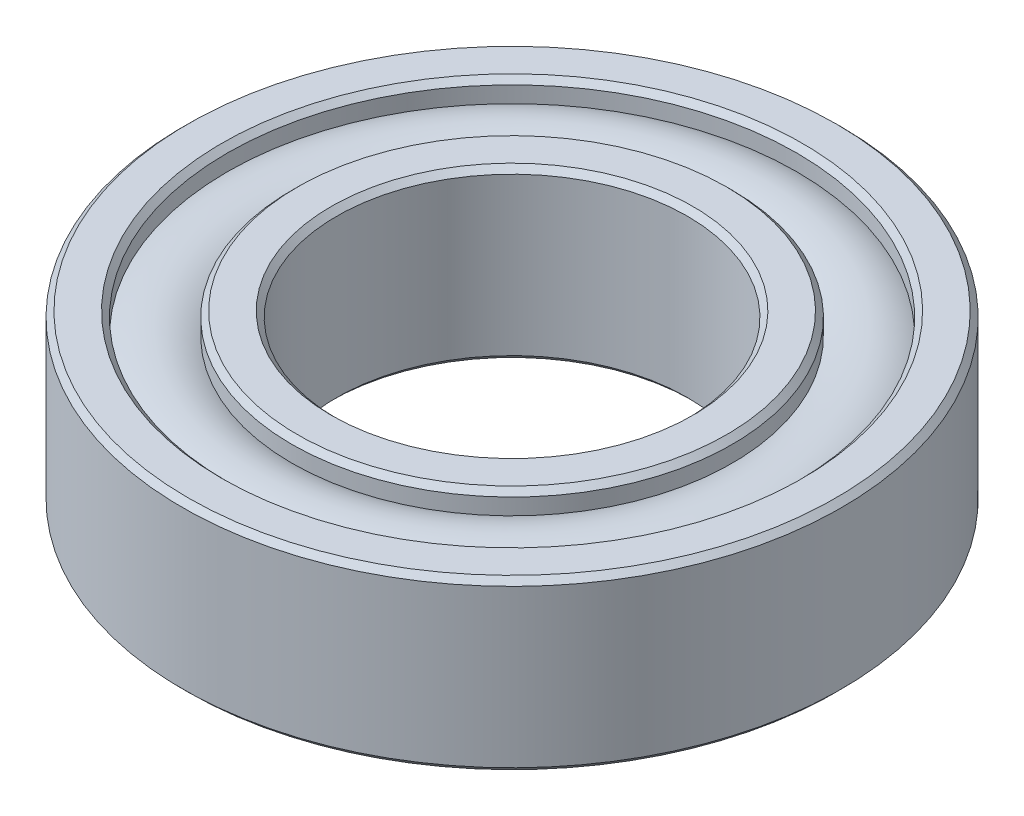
ISO-10303-21;
HEADER;
FILE_DESCRIPTION(('STEP AP214'),'2;1');
FILE_NAME('part.step','',(''),(''),'','','');
FILE_SCHEMA(('AUTOMOTIVE_DESIGN { 1 0 10303 214 1 1 1 1 }'));
ENDSEC;
DATA;
#1=APPLICATION_CONTEXT('core data for automotive mechanical design processes');
#2=APPLICATION_PROTOCOL_DEFINITION('international standard','automotive_design',2000,#1);
#3=PRODUCT_CONTEXT('',#1,'mechanical');
#4=PRODUCT('Part','Part','',(#3));
#5=PRODUCT_RELATED_PRODUCT_CATEGORY('part','',(#4));
#6=PRODUCT_DEFINITION_FORMATION('','',#4);
#7=PRODUCT_DEFINITION_CONTEXT('part definition',#1,'design');
#8=PRODUCT_DEFINITION('design','',#6,#7);
#9=PRODUCT_DEFINITION_SHAPE('','',#8);
#10=(LENGTH_UNIT() NAMED_UNIT(*) SI_UNIT(.MILLI.,.METRE.));
#11=(NAMED_UNIT(*) PLANE_ANGLE_UNIT() SI_UNIT($,.RADIAN.));
#12=(NAMED_UNIT(*) SI_UNIT($,.STERADIAN.) SOLID_ANGLE_UNIT());
#13=UNCERTAINTY_MEASURE_WITH_UNIT(LENGTH_MEASURE(1.E-05),#10,'distance_accuracy_value','');
#14=(GEOMETRIC_REPRESENTATION_CONTEXT(3) GLOBAL_UNCERTAINTY_ASSIGNED_CONTEXT((#13)) GLOBAL_UNIT_ASSIGNED_CONTEXT((#10,
#11,#12)) REPRESENTATION_CONTEXT('',''));
#15=CARTESIAN_POINT('',(0.,0.,0.));
#16=DIRECTION('',(0.,0.,1.));
#17=DIRECTION('',(1.,0.,0.));
#18=AXIS2_PLACEMENT_3D('',#15,#16,#17);
#19=CARTESIAN_POINT('',(1.11022302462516E-13,0.,0.));
#20=DIRECTION('',(0.,-1.,0.));
#21=DIRECTION('',(0.,0.,-1.));
#22=AXIS2_PLACEMENT_3D('',#19,#20,#21);
#23=CYLINDRICAL_SURFACE('',#22,12.5);
#24=CARTESIAN_POINT('',(1.11022302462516E-13,0.399999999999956,-1.66533453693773E-13));
#25=DIRECTION('',(0.,-1.,0.));
#26=DIRECTION('',(0.,0.,-1.));
#27=AXIS2_PLACEMENT_3D('',#24,#25,#26);
#28=CIRCLE('',#27,12.5);
#29=CARTESIAN_POINT('',(1.1518563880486E-13,0.399999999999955,-12.5000000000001));
#30=VERTEX_POINT('',#29);
#31=EDGE_CURVE('E85',#30,#30,#28,.T.);
#32=CARTESIAN_POINT('',(0.,11.6,-1.66533453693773E-13));
#33=DIRECTION('',(0.,1.,0.));
#34=DIRECTION('',(0.,0.,1.));
#35=AXIS2_PLACEMENT_3D('',#32,#33,#34);
#36=CIRCLE('',#35,12.5);
#37=CARTESIAN_POINT('',(1.1518563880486E-13,11.6,-12.5000000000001));
#38=VERTEX_POINT('',#37);
#39=EDGE_CURVE('E88',#38,#38,#36,.T.);
#40=CARTESIAN_POINT('',(1.1518563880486E-13,0.399999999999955,-12.5000000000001));
#41=CARTESIAN_POINT('',(1.1518563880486E-13,0.516666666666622,-12.5000000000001));
#42=CARTESIAN_POINT('',(1.1518563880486E-13,0.633333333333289,-12.5000000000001));
#43=CARTESIAN_POINT('',(1.1518563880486E-13,0.866666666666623,-12.5000000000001));
#44=CARTESIAN_POINT('',(1.1518563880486E-13,0.98333333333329,-12.5000000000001));
#45=CARTESIAN_POINT('',(1.1518563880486E-13,1.21666666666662,-12.5000000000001));
#46=CARTESIAN_POINT('',(1.1518563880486E-13,1.33333333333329,-12.5000000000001));
#47=CARTESIAN_POINT('',(1.1518563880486E-13,1.56666666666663,-12.5000000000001));
#48=CARTESIAN_POINT('',(1.1518563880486E-13,1.68333333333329,-12.5000000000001));
#49=CARTESIAN_POINT('',(1.1518563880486E-13,1.91666666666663,-12.5000000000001));
#50=CARTESIAN_POINT('',(1.1518563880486E-13,2.03333333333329,-12.5000000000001));
#51=CARTESIAN_POINT('',(1.1518563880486E-13,2.26666666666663,-12.5000000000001));
#52=CARTESIAN_POINT('',(1.1518563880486E-13,2.3833333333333,-12.5000000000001));
#53=CARTESIAN_POINT('',(1.1518563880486E-13,2.61666666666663,-12.5000000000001));
#54=CARTESIAN_POINT('',(1.1518563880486E-13,2.7333333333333,-12.5000000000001));
#55=CARTESIAN_POINT('',(1.1518563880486E-13,2.96666666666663,-12.5000000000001));
#56=CARTESIAN_POINT('',(1.1518563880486E-13,3.0833333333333,-12.5000000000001));
#57=CARTESIAN_POINT('',(1.1518563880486E-13,3.31666666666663,-12.5000000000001));
#58=CARTESIAN_POINT('',(1.1518563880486E-13,3.4333333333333,-12.5000000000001));
#59=CARTESIAN_POINT('',(1.1518563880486E-13,3.66666666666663,-12.5000000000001));
#60=CARTESIAN_POINT('',(1.1518563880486E-13,3.7833333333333,-12.5000000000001));
#61=CARTESIAN_POINT('',(1.1518563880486E-13,4.01666666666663,-12.5000000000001));
#62=CARTESIAN_POINT('',(1.1518563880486E-13,4.1333333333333,-12.5000000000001));
#63=CARTESIAN_POINT('',(1.1518563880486E-13,4.36666666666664,-12.5000000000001));
#64=CARTESIAN_POINT('',(1.1518563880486E-13,4.4833333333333,-12.5000000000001));
#65=CARTESIAN_POINT('',(1.1518563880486E-13,4.71666666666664,-12.5000000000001));
#66=CARTESIAN_POINT('',(1.1518563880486E-13,4.83333333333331,-12.5000000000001));
#67=CARTESIAN_POINT('',(1.1518563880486E-13,5.06666666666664,-12.5000000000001));
#68=CARTESIAN_POINT('',(1.1518563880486E-13,5.18333333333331,-12.5000000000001));
#69=CARTESIAN_POINT('',(1.1518563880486E-13,5.41666666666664,-12.5000000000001));
#70=CARTESIAN_POINT('',(1.1518563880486E-13,5.53333333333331,-12.5000000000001));
#71=CARTESIAN_POINT('',(1.1518563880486E-13,5.76666666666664,-12.5000000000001));
#72=CARTESIAN_POINT('',(1.1518563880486E-13,5.88333333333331,-12.5000000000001));
#73=CARTESIAN_POINT('',(1.1518563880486E-13,6.11666666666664,-12.5000000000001));
#74=CARTESIAN_POINT('',(1.1518563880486E-13,6.23333333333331,-12.5000000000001));
#75=CARTESIAN_POINT('',(1.1518563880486E-13,6.46666666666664,-12.5000000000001));
#76=CARTESIAN_POINT('',(1.1518563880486E-13,6.58333333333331,-12.5000000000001));
#77=CARTESIAN_POINT('',(1.1518563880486E-13,6.81666666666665,-12.5000000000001));
#78=CARTESIAN_POINT('',(1.1518563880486E-13,6.93333333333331,-12.5000000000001));
#79=CARTESIAN_POINT('',(1.1518563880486E-13,7.16666666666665,-12.5000000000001));
#80=CARTESIAN_POINT('',(1.1518563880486E-13,7.28333333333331,-12.5000000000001));
#81=CARTESIAN_POINT('',(1.1518563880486E-13,7.51666666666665,-12.5000000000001));
#82=CARTESIAN_POINT('',(1.1518563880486E-13,7.63333333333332,-12.5000000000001));
#83=CARTESIAN_POINT('',(1.1518563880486E-13,7.86666666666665,-12.5000000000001));
#84=CARTESIAN_POINT('',(1.1518563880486E-13,7.98333333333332,-12.5000000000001));
#85=CARTESIAN_POINT('',(1.1518563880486E-13,8.21666666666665,-12.5000000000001));
#86=CARTESIAN_POINT('',(1.1518563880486E-13,8.33333333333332,-12.5000000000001));
#87=CARTESIAN_POINT('',(1.1518563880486E-13,8.56666666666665,-12.5000000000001));
#88=CARTESIAN_POINT('',(1.1518563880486E-13,8.68333333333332,-12.5000000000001));
#89=CARTESIAN_POINT('',(1.1518563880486E-13,8.91666666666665,-12.5000000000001));
#90=CARTESIAN_POINT('',(1.1518563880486E-13,9.03333333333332,-12.5000000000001));
#91=CARTESIAN_POINT('',(1.1518563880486E-13,9.26666666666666,-12.5000000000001));
#92=CARTESIAN_POINT('',(1.1518563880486E-13,9.38333333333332,-12.5000000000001));
#93=CARTESIAN_POINT('',(1.1518563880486E-13,9.61666666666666,-12.5000000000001));
#94=CARTESIAN_POINT('',(1.1518563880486E-13,9.73333333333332,-12.5000000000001));
#95=CARTESIAN_POINT('',(1.1518563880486E-13,9.96666666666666,-12.5000000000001));
#96=CARTESIAN_POINT('',(1.1518563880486E-13,10.0833333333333,-12.5000000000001));
#97=CARTESIAN_POINT('',(1.1518563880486E-13,10.3166666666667,-12.5000000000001));
#98=CARTESIAN_POINT('',(1.1518563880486E-13,10.4333333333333,-12.5000000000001));
#99=CARTESIAN_POINT('',(1.1518563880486E-13,10.6666666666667,-12.5000000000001));
#100=CARTESIAN_POINT('',(1.1518563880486E-13,10.7833333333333,-12.5000000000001));
#101=CARTESIAN_POINT('',(1.1518563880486E-13,11.0166666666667,-12.5000000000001));
#102=CARTESIAN_POINT('',(1.1518563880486E-13,11.1333333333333,-12.5000000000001));
#103=CARTESIAN_POINT('',(1.1518563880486E-13,11.3666666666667,-12.5000000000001));
#104=CARTESIAN_POINT('',(1.1518563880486E-13,11.4833333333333,-12.5000000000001));
#105=CARTESIAN_POINT('',(1.1518563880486E-13,11.6,-12.5000000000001));
#106=B_SPLINE_CURVE_WITH_KNOTS('',3,(#40,#41,#42,#43,#44,#45,#46,#47,#48,#49,#50,#51,#52,#53,
#54,#55,#56,#57,#58,#59,#60,#61,#62,#63,#64,#65,#66,#67,#68,#69,#70,#71,#72,#73,#74,#75,#76,#77,
#78,#79,#80,#81,#82,#83,#84,#85,#86,#87,#88,#89,#90,#91,#92,#93,#94,#95,#96,#97,#98,#99,#100,
#101,#102,#103,#104,#105),.UNSPECIFIED.,.F.,.F.,(4,2,2,2,2,2,2,2,2,2,2,2,2,2,2,2,2,2,2,2,2,2,2,
2,2,2,2,2,2,2,2,2,4),(0.,0.350000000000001,0.700000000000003,1.05,1.40000000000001,
1.75000000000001,2.10000000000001,2.45000000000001,2.80000000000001,3.15000000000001,
3.50000000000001,3.85000000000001,4.20000000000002,4.55000000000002,4.90000000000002,
5.25000000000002,5.60000000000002,5.95000000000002,6.30000000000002,6.65000000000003,
7.00000000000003,7.35000000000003,7.70000000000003,8.05000000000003,8.40000000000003,
8.75000000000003,9.10000000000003,9.45000000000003,9.80000000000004,10.15,10.5,10.85,11.2),.UNSPECIFIED.);
#107=EDGE_CURVE('BSEAM36',#30,#38,#106,.T.);
#108=ORIENTED_EDGE('',*,*,#31,.T.);
#109=ORIENTED_EDGE('',*,*,#39,.T.);
#110=ORIENTED_EDGE('',*,*,#107,.T.);
#111=ORIENTED_EDGE('',*,*,#107,.F.);
#112=EDGE_LOOP('',(#108,#110,#109,#111));
#113=FACE_BOUND('',#112,.T.);
#114=ADVANCED_FACE('F36',(#113),#23,.F.);
#115=CARTESIAN_POINT('',(12.5000000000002,0.,0.));
#116=DIRECTION('',(0.,-1.,0.));
#117=DIRECTION('',(0.,0.,-1.));
#118=AXIS2_PLACEMENT_3D('',#115,#116,#117);
#119=PLANE('',#118);
#120=CARTESIAN_POINT('',(1.11022302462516E-13,0.,0.));
#121=DIRECTION('',(0.,-1.,0.));
#122=DIRECTION('',(0.,0.,-1.));
#123=AXIS2_PLACEMENT_3D('',#120,#121,#122);
#124=CIRCLE('',#123,12.9);
#125=CARTESIAN_POINT('',(1.15318865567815E-13,0.,-12.9000000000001));
#126=VERTEX_POINT('',#125);
#127=EDGE_CURVE('E79',#126,#126,#124,.F.);
#128=ORIENTED_EDGE('',*,*,#127,.T.);
#129=EDGE_LOOP('',(#128));
#130=FACE_BOUND('',#129,.T.);
#131=CARTESIAN_POINT('',(1.11022302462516E-13,0.,0.));
#132=DIRECTION('',(0.,-1.,0.));
#133=DIRECTION('',(0.,0.,-1.));
#134=AXIS2_PLACEMENT_3D('',#131,#132,#133);
#135=CIRCLE('',#134,15.3);
#136=CARTESIAN_POINT('',(1.16118226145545E-13,0.,-15.3000000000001));
#137=VERTEX_POINT('',#136);
#138=EDGE_CURVE('E82',#137,#137,#135,.T.);
#139=ORIENTED_EDGE('',*,*,#138,.T.);
#140=EDGE_LOOP('',(#139));
#141=FACE_BOUND('',#140,.T.);
#142=ADVANCED_FACE('F121',(#130,#141),#119,.T.);
#143=CARTESIAN_POINT('',(1.11022302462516E-13,0.,0.));
#144=DIRECTION('',(0.,-1.,0.));
#145=DIRECTION('',(0.,0.,-1.));
#146=AXIS2_PLACEMENT_3D('',#143,#144,#145);
#147=CYLINDRICAL_SURFACE('',#146,15.7);
#148=CARTESIAN_POINT('',(1.11022302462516E-13,0.399999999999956,-1.66533453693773E-13));
#149=DIRECTION('',(0.,-1.,0.));
#150=DIRECTION('',(0.,0.,-1.));
#151=AXIS2_PLACEMENT_3D('',#148,#149,#150);
#152=CIRCLE('',#151,15.7);
#153=CARTESIAN_POINT('',(1.162514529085E-13,0.399999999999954,-15.7000000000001));
#154=VERTEX_POINT('',#153);
#155=EDGE_CURVE('E76',#154,#154,#152,.F.);
#156=CARTESIAN_POINT('',(0.,1.56040542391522,-1.66533453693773E-13));
#157=DIRECTION('',(0.,-1.,0.));
#158=DIRECTION('',(0.,0.,-1.));
#159=AXIS2_PLACEMENT_3D('',#156,#157,#158);
#160=CIRCLE('',#159,15.7);
#161=CARTESIAN_POINT('',(1.162514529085E-13,1.56040542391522,-15.7000000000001));
#162=VERTEX_POINT('',#161);
#163=EDGE_CURVE('E91',#162,#162,#160,.T.);
#164=CARTESIAN_POINT('',(1.162514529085E-13,0.399999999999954,-15.7000000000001));
#165=CARTESIAN_POINT('',(1.162514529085E-13,0.412087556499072,-15.7000000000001));
#166=CARTESIAN_POINT('',(1.162514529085E-13,0.424175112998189,-15.7000000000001));
#167=CARTESIAN_POINT('',(1.162514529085E-13,0.448350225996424,-15.7000000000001));
#168=CARTESIAN_POINT('',(1.162514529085E-13,0.460437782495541,-15.7000000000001));
#169=CARTESIAN_POINT('',(1.162514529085E-13,0.484612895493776,-15.7000000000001));
#170=CARTESIAN_POINT('',(1.162514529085E-13,0.496700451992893,-15.7000000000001));
#171=CARTESIAN_POINT('',(1.162514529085E-13,0.520875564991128,-15.7000000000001));
#172=CARTESIAN_POINT('',(1.162514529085E-13,0.532963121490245,-15.7000000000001));
#173=CARTESIAN_POINT('',(1.162514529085E-13,0.55713823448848,-15.7000000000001));
#174=CARTESIAN_POINT('',(1.162514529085E-13,0.569225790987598,-15.7000000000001));
#175=CARTESIAN_POINT('',(1.162514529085E-13,0.593400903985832,-15.7000000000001));
#176=CARTESIAN_POINT('',(1.162514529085E-13,0.60548846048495,-15.7000000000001));
#177=CARTESIAN_POINT('',(1.162514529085E-13,0.629663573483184,-15.7000000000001));
#178=CARTESIAN_POINT('',(1.162514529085E-13,0.641751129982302,-15.7000000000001));
#179=CARTESIAN_POINT('',(1.162514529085E-13,0.665926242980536,-15.7000000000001));
#180=CARTESIAN_POINT('',(1.162514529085E-13,0.678013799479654,-15.7000000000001));
#181=CARTESIAN_POINT('',(1.162514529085E-13,0.702188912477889,-15.7000000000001));
#182=CARTESIAN_POINT('',(1.162514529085E-13,0.714276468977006,-15.7000000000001));
#183=CARTESIAN_POINT('',(1.162514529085E-13,0.738451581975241,-15.7000000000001));
#184=CARTESIAN_POINT('',(1.162514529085E-13,0.750539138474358,-15.7000000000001));
#185=CARTESIAN_POINT('',(1.162514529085E-13,0.774714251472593,-15.7000000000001));
#186=CARTESIAN_POINT('',(1.162514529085E-13,0.78680180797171,-15.7000000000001));
#187=CARTESIAN_POINT('',(1.162514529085E-13,0.810976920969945,-15.7000000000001));
#188=CARTESIAN_POINT('',(1.162514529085E-13,0.823064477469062,-15.7000000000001));
#189=CARTESIAN_POINT('',(1.162514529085E-13,0.847239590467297,-15.7000000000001));
#190=CARTESIAN_POINT('',(1.162514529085E-13,0.859327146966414,-15.7000000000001));
#191=CARTESIAN_POINT('',(1.162514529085E-13,0.883502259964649,-15.7000000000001));
#192=CARTESIAN_POINT('',(1.162514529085E-13,0.895589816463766,-15.7000000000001));
#193=CARTESIAN_POINT('',(1.162514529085E-13,0.919764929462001,-15.7000000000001));
#194=CARTESIAN_POINT('',(1.162514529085E-13,0.931852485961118,-15.7000000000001));
#195=CARTESIAN_POINT('',(1.162514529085E-13,0.956027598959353,-15.7000000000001));
#196=CARTESIAN_POINT('',(1.162514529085E-13,0.968115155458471,-15.7000000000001));
#197=CARTESIAN_POINT('',(1.162514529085E-13,0.992290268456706,-15.7000000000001));
#198=CARTESIAN_POINT('',(1.162514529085E-13,1.00437782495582,-15.7000000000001));
#199=CARTESIAN_POINT('',(1.162514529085E-13,1.02855293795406,-15.7000000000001));
#200=CARTESIAN_POINT('',(1.162514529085E-13,1.04064049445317,-15.7000000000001));
#201=CARTESIAN_POINT('',(1.162514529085E-13,1.06481560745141,-15.7000000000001));
#202=CARTESIAN_POINT('',(1.162514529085E-13,1.07690316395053,-15.7000000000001));
#203=CARTESIAN_POINT('',(1.162514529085E-13,1.10107827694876,-15.7000000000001));
#204=CARTESIAN_POINT('',(1.162514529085E-13,1.11316583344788,-15.7000000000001));
#205=CARTESIAN_POINT('',(1.162514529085E-13,1.13734094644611,-15.7000000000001));
#206=CARTESIAN_POINT('',(1.162514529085E-13,1.14942850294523,-15.7000000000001));
#207=CARTESIAN_POINT('',(1.162514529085E-13,1.17360361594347,-15.7000000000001));
#208=CARTESIAN_POINT('',(1.162514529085E-13,1.18569117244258,-15.7000000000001));
#209=CARTESIAN_POINT('',(1.162514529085E-13,1.20986628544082,-15.7000000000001));
#210=CARTESIAN_POINT('',(1.162514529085E-13,1.22195384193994,-15.7000000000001));
#211=CARTESIAN_POINT('',(1.162514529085E-13,1.24612895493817,-15.7000000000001));
#212=CARTESIAN_POINT('',(1.162514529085E-13,1.25821651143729,-15.7000000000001));
#213=CARTESIAN_POINT('',(1.162514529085E-13,1.28239162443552,-15.7000000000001));
#214=CARTESIAN_POINT('',(1.162514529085E-13,1.29447918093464,-15.7000000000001));
#215=CARTESIAN_POINT('',(1.162514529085E-13,1.31865429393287,-15.7000000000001));
#216=CARTESIAN_POINT('',(1.162514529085E-13,1.33074185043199,-15.7000000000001));
#217=CARTESIAN_POINT('',(1.162514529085E-13,1.35491696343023,-15.7000000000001));
#218=CARTESIAN_POINT('',(1.162514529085E-13,1.36700451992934,-15.7000000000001));
#219=CARTESIAN_POINT('',(1.162514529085E-13,1.39117963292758,-15.7000000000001));
#220=CARTESIAN_POINT('',(1.162514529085E-13,1.4032671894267,-15.7000000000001));
#221=CARTESIAN_POINT('',(1.162514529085E-13,1.42744230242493,-15.7000000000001));
#222=CARTESIAN_POINT('',(1.162514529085E-13,1.43952985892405,-15.7000000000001));
#223=CARTESIAN_POINT('',(1.162514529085E-13,1.46370497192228,-15.7000000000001));
#224=CARTESIAN_POINT('',(1.162514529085E-13,1.4757925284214,-15.7000000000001));
#225=CARTESIAN_POINT('',(1.162514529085E-13,1.49996764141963,-15.7000000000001));
#226=CARTESIAN_POINT('',(1.162514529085E-13,1.51205519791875,-15.7000000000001));
#227=CARTESIAN_POINT('',(1.162514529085E-13,1.53623031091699,-15.7000000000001));
#228=CARTESIAN_POINT('',(1.162514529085E-13,1.5483178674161,-15.7000000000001));
#229=CARTESIAN_POINT('',(1.162514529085E-13,1.56040542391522,-15.7000000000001));
#230=B_SPLINE_CURVE_WITH_KNOTS('',3,(#164,#165,#166,#167,#168,#169,#170,#171,#172,#173,#174,
#175,#176,#177,#178,#179,#180,#181,#182,#183,#184,#185,#186,#187,#188,#189,#190,#191,#192,#193,
#194,#195,#196,#197,#198,#199,#200,#201,#202,#203,#204,#205,#206,#207,#208,#209,#210,#211,#212,
#213,#214,#215,#216,#217,#218,#219,#220,#221,#222,#223,#224,#225,#226,#227,#228,#229),
.UNSPECIFIED.,.F.,.F.,(4,2,2,2,2,2,2,2,2,2,2,2,2,2,2,2,2,2,2,2,2,2,2,2,2,2,2,2,2,2,2,2,4),(0.,
0.0362626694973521,0.0725253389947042,0.108788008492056,0.145050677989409,0.181313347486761,
0.217576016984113,0.253838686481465,0.290101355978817,0.326364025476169,0.362626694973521,
0.398889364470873,0.435152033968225,0.471414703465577,0.507677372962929,0.543940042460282,
0.580202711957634,0.616465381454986,0.652728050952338,0.68899072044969,0.725253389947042,
0.761516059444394,0.797778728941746,0.834041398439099,0.870304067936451,0.906566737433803,
0.942829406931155,0.979092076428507,1.01535474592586,1.05161741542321,1.08788008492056,
1.12414275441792,1.16040542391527),.UNSPECIFIED.);
#231=EDGE_CURVE('BSEAM126',#154,#162,#230,.T.);
#232=ORIENTED_EDGE('',*,*,#155,.T.);
#233=ORIENTED_EDGE('',*,*,#163,.T.);
#234=ORIENTED_EDGE('',*,*,#231,.T.);
#235=ORIENTED_EDGE('',*,*,#231,.F.);
#236=EDGE_LOOP('',(#232,#234,#233,#235));
#237=FACE_BOUND('',#236,.T.);
#238=ADVANCED_FACE('F126',(#237),#147,.T.);
#239=CARTESIAN_POINT('',(0.,6.00000000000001,-1.66533453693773E-13));
#240=DIRECTION('',(0.,-1.,0.));
#241=DIRECTION('',(0.,0.,-1.));
#242=AXIS2_PLACEMENT_3D('',#239,#240,#241);
#243=TOROIDAL_SURFACE('',#242,18.,5.);
#244=CARTESIAN_POINT('',(0.,1.56040542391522,-1.66533453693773E-13));
#245=DIRECTION('',(0.,-1.,0.));
#246=DIRECTION('',(0.,0.,-1.));
#247=AXIS2_PLACEMENT_3D('',#244,#245,#246);
#248=CIRCLE('',#247,20.3);
#249=CARTESIAN_POINT('',(1.17783560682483E-13,1.56040542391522,-20.3000000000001));
#250=VERTEX_POINT('',#249);
#251=EDGE_CURVE('E94',#250,#250,#248,.T.);
#252=ORIENTED_EDGE('',*,*,#251,.T.);
#253=EDGE_LOOP('',(#252));
#254=FACE_BOUND('',#253,.T.);
#255=ORIENTED_EDGE('',*,*,#163,.F.);
#256=EDGE_LOOP('',(#255));
#257=FACE_BOUND('',#256,.T.);
#258=ADVANCED_FACE('F273',(#254,#257),#243,.T.);
#259=CARTESIAN_POINT('',(1.11022302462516E-13,0.,0.));
#260=DIRECTION('',(0.,-1.,0.));
#261=DIRECTION('',(0.,0.,-1.));
#262=AXIS2_PLACEMENT_3D('',#259,#260,#261);
#263=CYLINDRICAL_SURFACE('',#262,20.3);
#264=CARTESIAN_POINT('',(1.11022302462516E-13,0.399999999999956,-1.66533453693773E-13));
#265=DIRECTION('',(0.,-1.,0.));
#266=DIRECTION('',(0.,0.,-1.));
#267=AXIS2_PLACEMENT_3D('',#264,#265,#266);
#268=CIRCLE('',#267,20.3);
#269=CARTESIAN_POINT('',(1.17783560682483E-13,0.399999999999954,-20.3000000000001));
#270=VERTEX_POINT('',#269);
#271=EDGE_CURVE('E73',#270,#270,#268,.T.);
#272=CARTESIAN_POINT('',(1.17783560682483E-13,0.399999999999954,-20.3000000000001));
#273=CARTESIAN_POINT('',(1.17783560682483E-13,0.412087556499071,-20.3000000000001));
#274=CARTESIAN_POINT('',(1.17783560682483E-13,0.424175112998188,-20.3000000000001));
#275=CARTESIAN_POINT('',(1.17783560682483E-13,0.448350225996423,-20.3000000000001));
#276=CARTESIAN_POINT('',(1.17783560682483E-13,0.460437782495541,-20.3000000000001));
#277=CARTESIAN_POINT('',(1.17783560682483E-13,0.484612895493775,-20.3000000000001));
#278=CARTESIAN_POINT('',(1.17783560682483E-13,0.496700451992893,-20.3000000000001));
#279=CARTESIAN_POINT('',(1.17783560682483E-13,0.520875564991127,-20.3000000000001));
#280=CARTESIAN_POINT('',(1.17783560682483E-13,0.532963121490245,-20.3000000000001));
#281=CARTESIAN_POINT('',(1.17783560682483E-13,0.557138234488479,-20.3000000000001));
#282=CARTESIAN_POINT('',(1.17783560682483E-13,0.569225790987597,-20.3000000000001));
#283=CARTESIAN_POINT('',(1.17783560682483E-13,0.593400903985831,-20.3000000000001));
#284=CARTESIAN_POINT('',(1.17783560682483E-13,0.605488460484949,-20.3000000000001));
#285=CARTESIAN_POINT('',(1.17783560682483E-13,0.629663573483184,-20.3000000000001));
#286=CARTESIAN_POINT('',(1.17783560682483E-13,0.641751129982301,-20.3000000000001));
#287=CARTESIAN_POINT('',(1.17783560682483E-13,0.665926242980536,-20.3000000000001));
#288=CARTESIAN_POINT('',(1.17783560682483E-13,0.678013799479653,-20.3000000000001));
#289=CARTESIAN_POINT('',(1.17783560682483E-13,0.702188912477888,-20.3000000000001));
#290=CARTESIAN_POINT('',(1.17783560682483E-13,0.714276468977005,-20.3000000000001));
#291=CARTESIAN_POINT('',(1.17783560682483E-13,0.73845158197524,-20.3000000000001));
#292=CARTESIAN_POINT('',(1.17783560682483E-13,0.750539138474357,-20.3000000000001));
#293=CARTESIAN_POINT('',(1.17783560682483E-13,0.774714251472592,-20.3000000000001));
#294=CARTESIAN_POINT('',(1.17783560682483E-13,0.786801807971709,-20.3000000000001));
#295=CARTESIAN_POINT('',(1.17783560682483E-13,0.810976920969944,-20.3000000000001));
#296=CARTESIAN_POINT('',(1.17783560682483E-13,0.823064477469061,-20.3000000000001));
#297=CARTESIAN_POINT('',(1.17783560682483E-13,0.847239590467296,-20.3000000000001));
#298=CARTESIAN_POINT('',(1.17783560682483E-13,0.859327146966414,-20.3000000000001));
#299=CARTESIAN_POINT('',(1.17783560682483E-13,0.883502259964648,-20.3000000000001));
#300=CARTESIAN_POINT('',(1.17783560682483E-13,0.895589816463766,-20.3000000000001));
#301=CARTESIAN_POINT('',(1.17783560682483E-13,0.919764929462,-20.3000000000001));
#302=CARTESIAN_POINT('',(1.17783560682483E-13,0.931852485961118,-20.3000000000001));
#303=CARTESIAN_POINT('',(1.17783560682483E-13,0.956027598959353,-20.3000000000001));
#304=CARTESIAN_POINT('',(1.17783560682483E-13,0.96811515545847,-20.3000000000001));
#305=CARTESIAN_POINT('',(1.17783560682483E-13,0.992290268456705,-20.3000000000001));
#306=CARTESIAN_POINT('',(1.17783560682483E-13,1.00437782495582,-20.3000000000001));
#307=CARTESIAN_POINT('',(1.17783560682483E-13,1.02855293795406,-20.3000000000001));
#308=CARTESIAN_POINT('',(1.17783560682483E-13,1.04064049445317,-20.3000000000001));
#309=CARTESIAN_POINT('',(1.17783560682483E-13,1.06481560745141,-20.3000000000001));
#310=CARTESIAN_POINT('',(1.17783560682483E-13,1.07690316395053,-20.3000000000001));
#311=CARTESIAN_POINT('',(1.17783560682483E-13,1.10107827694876,-20.3000000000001));
#312=CARTESIAN_POINT('',(1.17783560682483E-13,1.11316583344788,-20.3000000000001));
#313=CARTESIAN_POINT('',(1.17783560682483E-13,1.13734094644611,-20.3000000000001));
#314=CARTESIAN_POINT('',(1.17783560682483E-13,1.14942850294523,-20.3000000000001));
#315=CARTESIAN_POINT('',(1.17783560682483E-13,1.17360361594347,-20.3000000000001));
#316=CARTESIAN_POINT('',(1.17783560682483E-13,1.18569117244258,-20.3000000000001));
#317=CARTESIAN_POINT('',(1.17783560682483E-13,1.20986628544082,-20.3000000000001));
#318=CARTESIAN_POINT('',(1.17783560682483E-13,1.22195384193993,-20.3000000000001));
#319=CARTESIAN_POINT('',(1.17783560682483E-13,1.24612895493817,-20.3000000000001));
#320=CARTESIAN_POINT('',(1.17783560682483E-13,1.25821651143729,-20.3000000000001));
#321=CARTESIAN_POINT('',(1.17783560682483E-13,1.28239162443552,-20.3000000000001));
#322=CARTESIAN_POINT('',(1.17783560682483E-13,1.29447918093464,-20.3000000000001));
#323=CARTESIAN_POINT('',(1.17783560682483E-13,1.31865429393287,-20.3000000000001));
#324=CARTESIAN_POINT('',(1.17783560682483E-13,1.33074185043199,-20.3000000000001));
#325=CARTESIAN_POINT('',(1.17783560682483E-13,1.35491696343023,-20.3000000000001));
#326=CARTESIAN_POINT('',(1.17783560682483E-13,1.36700451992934,-20.3000000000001));
#327=CARTESIAN_POINT('',(1.17783560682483E-13,1.39117963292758,-20.3000000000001));
#328=CARTESIAN_POINT('',(1.17783560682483E-13,1.4032671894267,-20.3000000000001));
#329=CARTESIAN_POINT('',(1.17783560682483E-13,1.42744230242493,-20.3000000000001));
#330=CARTESIAN_POINT('',(1.17783560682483E-13,1.43952985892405,-20.3000000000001));
#331=CARTESIAN_POINT('',(1.17783560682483E-13,1.46370497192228,-20.3000000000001));
#332=CARTESIAN_POINT('',(1.17783560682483E-13,1.4757925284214,-20.3000000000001));
#333=CARTESIAN_POINT('',(1.17783560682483E-13,1.49996764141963,-20.3000000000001));
#334=CARTESIAN_POINT('',(1.17783560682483E-13,1.51205519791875,-20.3000000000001));
#335=CARTESIAN_POINT('',(1.17783560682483E-13,1.53623031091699,-20.3000000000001));
#336=CARTESIAN_POINT('',(1.17783560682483E-13,1.5483178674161,-20.3000000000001));
#337=CARTESIAN_POINT('',(1.17783560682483E-13,1.56040542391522,-20.3000000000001));
#338=B_SPLINE_CURVE_WITH_KNOTS('',3,(#272,#273,#274,#275,#276,#277,#278,#279,#280,#281,#282,
#283,#284,#285,#286,#287,#288,#289,#290,#291,#292,#293,#294,#295,#296,#297,#298,#299,#300,#301,
#302,#303,#304,#305,#306,#307,#308,#309,#310,#311,#312,#313,#314,#315,#316,#317,#318,#319,#320,
#321,#322,#323,#324,#325,#326,#327,#328,#329,#330,#331,#332,#333,#334,#335,#336,#337),
.UNSPECIFIED.,.F.,.F.,(4,2,2,2,2,2,2,2,2,2,2,2,2,2,2,2,2,2,2,2,2,2,2,2,2,2,2,2,2,2,2,2,4),(0.,
0.0362626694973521,0.0725253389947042,0.108788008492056,0.145050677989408,0.18131334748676,
0.217576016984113,0.253838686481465,0.290101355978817,0.326364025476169,0.362626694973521,
0.398889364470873,0.435152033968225,0.471414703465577,0.507677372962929,0.543940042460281,
0.580202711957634,0.616465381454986,0.652728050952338,0.68899072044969,0.725253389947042,
0.761516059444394,0.797778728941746,0.834041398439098,0.870304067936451,0.906566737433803,
0.942829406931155,0.979092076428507,1.01535474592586,1.05161741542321,1.08788008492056,
1.12414275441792,1.16040542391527),.UNSPECIFIED.);
#339=EDGE_CURVE('BSEAM264',#270,#250,#338,.T.);
#340=ORIENTED_EDGE('',*,*,#271,.T.);
#341=ORIENTED_EDGE('',*,*,#251,.F.);
#342=ORIENTED_EDGE('',*,*,#339,.T.);
#343=ORIENTED_EDGE('',*,*,#339,.F.);
#344=EDGE_LOOP('',(#340,#342,#341,#343));
#345=FACE_BOUND('',#344,.T.);
#346=ADVANCED_FACE('F264',(#345),#263,.F.);
#347=CARTESIAN_POINT('',(20.3000000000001,0.,0.));
#348=DIRECTION('',(0.,-1.,0.));
#349=DIRECTION('',(0.,0.,-1.));
#350=AXIS2_PLACEMENT_3D('',#347,#348,#349);
#351=PLANE('',#350);
#352=CARTESIAN_POINT('',(1.11022302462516E-13,0.,0.));
#353=DIRECTION('',(0.,-1.,0.));
#354=DIRECTION('',(0.,0.,-1.));
#355=AXIS2_PLACEMENT_3D('',#352,#353,#354);
#356=CIRCLE('',#355,20.7);
#357=CARTESIAN_POINT('',(1.17916787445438E-13,0.,-20.7000000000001));
#358=VERTEX_POINT('',#357);
#359=EDGE_CURVE('E67',#358,#358,#356,.F.);
#360=ORIENTED_EDGE('',*,*,#359,.T.);
#361=EDGE_LOOP('',(#360));
#362=FACE_BOUND('',#361,.T.);
#363=CARTESIAN_POINT('',(1.11022302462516E-13,0.,0.));
#364=DIRECTION('',(0.,-1.,0.));
#365=DIRECTION('',(0.,0.,-1.));
#366=AXIS2_PLACEMENT_3D('',#363,#364,#365);
#367=CIRCLE('',#366,23.1);
#368=CARTESIAN_POINT('',(1.18716148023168E-13,0.,-23.1000000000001));
#369=VERTEX_POINT('',#368);
#370=EDGE_CURVE('E70',#369,#369,#367,.T.);
#371=ORIENTED_EDGE('',*,*,#370,.T.);
#372=EDGE_LOOP('',(#371));
#373=FACE_BOUND('',#372,.T.);
#374=ADVANCED_FACE('F255',(#362,#373),#351,.T.);
#375=CARTESIAN_POINT('',(1.11022302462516E-13,0.,0.));
#376=DIRECTION('',(0.,-1.,0.));
#377=DIRECTION('',(0.,0.,-1.));
#378=AXIS2_PLACEMENT_3D('',#375,#376,#377);
#379=CYLINDRICAL_SURFACE('',#378,23.5);
#380=CARTESIAN_POINT('',(1.11022302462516E-13,0.399999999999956,-1.66533453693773E-13));
#381=DIRECTION('',(0.,-1.,0.));
#382=DIRECTION('',(0.,0.,-1.));
#383=AXIS2_PLACEMENT_3D('',#380,#381,#382);
#384=CIRCLE('',#383,23.5);
#385=CARTESIAN_POINT('',(1.18849374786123E-13,0.399999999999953,-23.5000000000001));
#386=VERTEX_POINT('',#385);
#387=EDGE_CURVE('E61',#386,#386,#384,.F.);
#388=CARTESIAN_POINT('',(0.,11.6,-1.66533453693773E-13));
#389=DIRECTION('',(0.,1.,0.));
#390=DIRECTION('',(0.,0.,1.));
#391=AXIS2_PLACEMENT_3D('',#388,#389,#390);
#392=CIRCLE('',#391,23.5);
#393=CARTESIAN_POINT('',(1.18849374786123E-13,11.6,-23.5000000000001));
#394=VERTEX_POINT('',#393);
#395=EDGE_CURVE('E64',#394,#394,#392,.F.);
#396=CARTESIAN_POINT('',(1.18849374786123E-13,0.399999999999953,-23.5000000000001));
#397=CARTESIAN_POINT('',(1.18849374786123E-13,0.51666666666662,-23.5000000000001));
#398=CARTESIAN_POINT('',(1.18849374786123E-13,0.633333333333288,-23.5000000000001));
#399=CARTESIAN_POINT('',(1.18849374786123E-13,0.866666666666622,-23.5000000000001));
#400=CARTESIAN_POINT('',(1.18849374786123E-13,0.983333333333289,-23.5000000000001));
#401=CARTESIAN_POINT('',(1.18849374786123E-13,1.21666666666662,-23.5000000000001));
#402=CARTESIAN_POINT('',(1.18849374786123E-13,1.33333333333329,-23.5000000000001));
#403=CARTESIAN_POINT('',(1.18849374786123E-13,1.56666666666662,-23.5000000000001));
#404=CARTESIAN_POINT('',(1.18849374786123E-13,1.68333333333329,-23.5000000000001));
#405=CARTESIAN_POINT('',(1.18849374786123E-13,1.91666666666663,-23.5000000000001));
#406=CARTESIAN_POINT('',(1.18849374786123E-13,2.03333333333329,-23.5000000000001));
#407=CARTESIAN_POINT('',(1.18849374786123E-13,2.26666666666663,-23.5000000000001));
#408=CARTESIAN_POINT('',(1.18849374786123E-13,2.38333333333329,-23.5000000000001));
#409=CARTESIAN_POINT('',(1.18849374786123E-13,2.61666666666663,-23.5000000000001));
#410=CARTESIAN_POINT('',(1.18849374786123E-13,2.7333333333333,-23.5000000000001));
#411=CARTESIAN_POINT('',(1.18849374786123E-13,2.96666666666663,-23.5000000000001));
#412=CARTESIAN_POINT('',(1.18849374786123E-13,3.0833333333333,-23.5000000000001));
#413=CARTESIAN_POINT('',(1.18849374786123E-13,3.31666666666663,-23.5000000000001));
#414=CARTESIAN_POINT('',(1.18849374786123E-13,3.4333333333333,-23.5000000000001));
#415=CARTESIAN_POINT('',(1.18849374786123E-13,3.66666666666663,-23.5000000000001));
#416=CARTESIAN_POINT('',(1.18849374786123E-13,3.7833333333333,-23.5000000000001));
#417=CARTESIAN_POINT('',(1.18849374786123E-13,4.01666666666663,-23.5000000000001));
#418=CARTESIAN_POINT('',(1.18849374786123E-13,4.1333333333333,-23.5000000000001));
#419=CARTESIAN_POINT('',(1.18849374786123E-13,4.36666666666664,-23.5000000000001));
#420=CARTESIAN_POINT('',(1.18849374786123E-13,4.4833333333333,-23.5000000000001));
#421=CARTESIAN_POINT('',(1.18849374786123E-13,4.71666666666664,-23.5000000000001));
#422=CARTESIAN_POINT('',(1.18849374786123E-13,4.8333333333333,-23.5000000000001));
#423=CARTESIAN_POINT('',(1.18849374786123E-13,5.06666666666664,-23.5000000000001));
#424=CARTESIAN_POINT('',(1.18849374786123E-13,5.18333333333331,-23.5000000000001));
#425=CARTESIAN_POINT('',(1.18849374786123E-13,5.41666666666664,-23.5000000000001));
#426=CARTESIAN_POINT('',(1.18849374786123E-13,5.53333333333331,-23.5000000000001));
#427=CARTESIAN_POINT('',(1.18849374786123E-13,5.76666666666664,-23.5000000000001));
#428=CARTESIAN_POINT('',(1.18849374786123E-13,5.88333333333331,-23.5000000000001));
#429=CARTESIAN_POINT('',(1.18849374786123E-13,6.11666666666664,-23.5000000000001));
#430=CARTESIAN_POINT('',(1.18849374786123E-13,6.23333333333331,-23.5000000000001));
#431=CARTESIAN_POINT('',(1.18849374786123E-13,6.46666666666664,-23.5000000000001));
#432=CARTESIAN_POINT('',(1.18849374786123E-13,6.58333333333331,-23.5000000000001));
#433=CARTESIAN_POINT('',(1.18849374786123E-13,6.81666666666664,-23.5000000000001));
#434=CARTESIAN_POINT('',(1.18849374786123E-13,6.93333333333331,-23.5000000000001));
#435=CARTESIAN_POINT('',(1.18849374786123E-13,7.16666666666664,-23.5000000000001));
#436=CARTESIAN_POINT('',(1.18849374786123E-13,7.28333333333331,-23.5000000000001));
#437=CARTESIAN_POINT('',(1.18849374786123E-13,7.51666666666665,-23.5000000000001));
#438=CARTESIAN_POINT('',(1.18849374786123E-13,7.63333333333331,-23.5000000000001));
#439=CARTESIAN_POINT('',(1.18849374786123E-13,7.86666666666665,-23.5000000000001));
#440=CARTESIAN_POINT('',(1.18849374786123E-13,7.98333333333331,-23.5000000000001));
#441=CARTESIAN_POINT('',(1.18849374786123E-13,8.21666666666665,-23.5000000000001));
#442=CARTESIAN_POINT('',(1.18849374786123E-13,8.33333333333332,-23.5000000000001));
#443=CARTESIAN_POINT('',(1.18849374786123E-13,8.56666666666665,-23.5000000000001));
#444=CARTESIAN_POINT('',(1.18849374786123E-13,8.68333333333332,-23.5000000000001));
#445=CARTESIAN_POINT('',(1.18849374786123E-13,8.91666666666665,-23.5000000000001));
#446=CARTESIAN_POINT('',(1.18849374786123E-13,9.03333333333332,-23.5000000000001));
#447=CARTESIAN_POINT('',(1.18849374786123E-13,9.26666666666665,-23.5000000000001));
#448=CARTESIAN_POINT('',(1.18849374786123E-13,9.38333333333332,-23.5000000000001));
#449=CARTESIAN_POINT('',(1.18849374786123E-13,9.61666666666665,-23.5000000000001));
#450=CARTESIAN_POINT('',(1.18849374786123E-13,9.73333333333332,-23.5000000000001));
#451=CARTESIAN_POINT('',(1.18849374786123E-13,9.96666666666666,-23.5000000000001));
#452=CARTESIAN_POINT('',(1.18849374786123E-13,10.0833333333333,-23.5000000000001));
#453=CARTESIAN_POINT('',(1.18849374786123E-13,10.3166666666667,-23.5000000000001));
#454=CARTESIAN_POINT('',(1.18849374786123E-13,10.4333333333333,-23.5000000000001));
#455=CARTESIAN_POINT('',(1.18849374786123E-13,10.6666666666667,-23.5000000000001));
#456=CARTESIAN_POINT('',(1.18849374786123E-13,10.7833333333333,-23.5000000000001));
#457=CARTESIAN_POINT('',(1.18849374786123E-13,11.0166666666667,-23.5000000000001));
#458=CARTESIAN_POINT('',(1.18849374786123E-13,11.1333333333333,-23.5000000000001));
#459=CARTESIAN_POINT('',(1.18849374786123E-13,11.3666666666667,-23.5000000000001));
#460=CARTESIAN_POINT('',(1.18849374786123E-13,11.4833333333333,-23.5000000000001));
#461=CARTESIAN_POINT('',(1.18849374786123E-13,11.6,-23.5000000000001));
#462=B_SPLINE_CURVE_WITH_KNOTS('',3,(#396,#397,#398,#399,#400,#401,#402,#403,#404,#405,#406,
#407,#408,#409,#410,#411,#412,#413,#414,#415,#416,#417,#418,#419,#420,#421,#422,#423,#424,#425,
#426,#427,#428,#429,#430,#431,#432,#433,#434,#435,#436,#437,#438,#439,#440,#441,#442,#443,#444,
#445,#446,#447,#448,#449,#450,#451,#452,#453,#454,#455,#456,#457,#458,#459,#460,#461),
.UNSPECIFIED.,.F.,.F.,(4,2,2,2,2,2,2,2,2,2,2,2,2,2,2,2,2,2,2,2,2,2,2,2,2,2,2,2,2,2,2,2,4),(0.,
0.350000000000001,0.700000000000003,1.05,1.40000000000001,1.75000000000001,2.10000000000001,
2.45000000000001,2.80000000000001,3.15000000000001,3.50000000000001,3.85000000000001,
4.20000000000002,4.55000000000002,4.90000000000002,5.25000000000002,5.60000000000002,
5.95000000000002,6.30000000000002,6.65000000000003,7.00000000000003,7.35000000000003,
7.70000000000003,8.05000000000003,8.40000000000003,8.75000000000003,9.10000000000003,
9.45000000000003,9.80000000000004,10.15,10.5,10.85,11.2),.UNSPECIFIED.);
#463=EDGE_CURVE('BSEAM246',#386,#394,#462,.T.);
#464=ORIENTED_EDGE('',*,*,#387,.T.);
#465=ORIENTED_EDGE('',*,*,#395,.T.);
#466=ORIENTED_EDGE('',*,*,#463,.T.);
#467=ORIENTED_EDGE('',*,*,#463,.F.);
#468=EDGE_LOOP('',(#464,#466,#465,#467));
#469=FACE_BOUND('',#468,.T.);
#470=ADVANCED_FACE('F246',(#469),#379,.T.);
#471=CARTESIAN_POINT('',(20.3000000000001,12.,0.));
#472=DIRECTION('',(0.,1.,0.));
#473=DIRECTION('',(0.,0.,1.));
#474=AXIS2_PLACEMENT_3D('',#471,#472,#473);
#475=PLANE('',#474);
#476=CARTESIAN_POINT('',(0.,12.,0.));
#477=DIRECTION('',(0.,1.,0.));
#478=DIRECTION('',(0.,0.,1.));
#479=AXIS2_PLACEMENT_3D('',#476,#477,#478);
#480=CIRCLE('',#479,23.1);
#481=CARTESIAN_POINT('',(0.,12.,-23.1000000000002));
#482=VERTEX_POINT('',#481);
#483=EDGE_CURVE('E55',#482,#482,#480,.T.);
#484=ORIENTED_EDGE('',*,*,#483,.T.);
#485=EDGE_LOOP('',(#484));
#486=FACE_BOUND('',#485,.T.);
#487=CARTESIAN_POINT('',(0.,12.,0.));
#488=DIRECTION('',(0.,1.,0.));
#489=DIRECTION('',(0.,0.,1.));
#490=AXIS2_PLACEMENT_3D('',#487,#488,#489);
#491=CIRCLE('',#490,20.7);
#492=CARTESIAN_POINT('',(0.,12.,20.7000000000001));
#493=VERTEX_POINT('',#492);
#494=EDGE_CURVE('E58',#493,#493,#491,.F.);
#495=ORIENTED_EDGE('',*,*,#494,.T.);
#496=EDGE_LOOP('',(#495));
#497=FACE_BOUND('',#496,.T.);
#498=ADVANCED_FACE('F237',(#486,#497),#475,.T.);
#499=CARTESIAN_POINT('',(1.11022302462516E-13,0.,0.));
#500=DIRECTION('',(0.,-1.,0.));
#501=DIRECTION('',(0.,0.,-1.));
#502=AXIS2_PLACEMENT_3D('',#499,#500,#501);
#503=CYLINDRICAL_SURFACE('',#502,20.3);
#504=CARTESIAN_POINT('',(0.,11.6,-1.66533453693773E-13));
#505=DIRECTION('',(0.,0.999999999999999,0.));
#506=DIRECTION('',(0.,0.,1.));
#507=AXIS2_PLACEMENT_3D('',#504,#505,#506);
#508=CIRCLE('',#507,20.3);
#509=CARTESIAN_POINT('',(1.17783560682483E-13,11.6,-20.3000000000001));
#510=VERTEX_POINT('',#509);
#511=EDGE_CURVE('E50',#510,#510,#508,.T.);
#512=CARTESIAN_POINT('',(0.,10.4395945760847,0.));
#513=DIRECTION('',(0.,-1.,0.));
#514=DIRECTION('',(0.,0.,-1.));
#515=AXIS2_PLACEMENT_3D('',#512,#513,#514);
#516=CIRCLE('',#515,20.3);
#517=CARTESIAN_POINT('',(1.17783560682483E-13,10.4395945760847,-20.3000000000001));
#518=VERTEX_POINT('',#517);
#519=EDGE_CURVE('E97',#518,#518,#516,.T.);
#520=CARTESIAN_POINT('',(1.17783560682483E-13,11.6,-20.3000000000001));
#521=CARTESIAN_POINT('',(1.17783560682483E-13,11.5879124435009,-20.3000000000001));
#522=CARTESIAN_POINT('',(1.17783560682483E-13,11.5758248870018,-20.3000000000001));
#523=CARTESIAN_POINT('',(1.17783560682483E-13,11.5516497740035,-20.3000000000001));
#524=CARTESIAN_POINT('',(1.17783560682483E-13,11.5395622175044,-20.3000000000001));
#525=CARTESIAN_POINT('',(1.17783560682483E-13,11.5153871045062,-20.3000000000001));
#526=CARTESIAN_POINT('',(1.17783560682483E-13,11.5032995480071,-20.3000000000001));
#527=CARTESIAN_POINT('',(1.17783560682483E-13,11.4791244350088,-20.3000000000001));
#528=CARTESIAN_POINT('',(1.17783560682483E-13,11.4670368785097,-20.3000000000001));
#529=CARTESIAN_POINT('',(1.17783560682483E-13,11.4428617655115,-20.3000000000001));
#530=CARTESIAN_POINT('',(1.17783560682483E-13,11.4307742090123,-20.3000000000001));
#531=CARTESIAN_POINT('',(1.17783560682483E-13,11.4065990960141,-20.3000000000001));
#532=CARTESIAN_POINT('',(1.17783560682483E-13,11.394511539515,-20.3000000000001));
#533=CARTESIAN_POINT('',(1.17783560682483E-13,11.3703364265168,-20.3000000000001));
#534=CARTESIAN_POINT('',(1.17783560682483E-13,11.3582488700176,-20.3000000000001));
#535=CARTESIAN_POINT('',(1.17783560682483E-13,11.3340737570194,-20.3000000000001));
#536=CARTESIAN_POINT('',(1.17783560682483E-13,11.3219862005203,-20.3000000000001));
#537=CARTESIAN_POINT('',(1.17783560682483E-13,11.297811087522,-20.3000000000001));
#538=CARTESIAN_POINT('',(1.17783560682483E-13,11.2857235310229,-20.3000000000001));
#539=CARTESIAN_POINT('',(1.17783560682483E-13,11.2615484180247,-20.3000000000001));
#540=CARTESIAN_POINT('',(1.17783560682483E-13,11.2494608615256,-20.3000000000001));
#541=CARTESIAN_POINT('',(1.17783560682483E-13,11.2252857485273,-20.3000000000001));
#542=CARTESIAN_POINT('',(1.17783560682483E-13,11.2131981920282,-20.3000000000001));
#543=CARTESIAN_POINT('',(1.17783560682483E-13,11.18902307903,-20.3000000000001));
#544=CARTESIAN_POINT('',(1.17783560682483E-13,11.1769355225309,-20.3000000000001));
#545=CARTESIAN_POINT('',(1.17783560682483E-13,11.1527604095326,-20.3000000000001));
#546=CARTESIAN_POINT('',(1.17783560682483E-13,11.1406728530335,-20.3000000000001));
#547=CARTESIAN_POINT('',(1.17783560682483E-13,11.1164977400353,-20.3000000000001));
#548=CARTESIAN_POINT('',(1.17783560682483E-13,11.1044101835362,-20.3000000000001));
#549=CARTESIAN_POINT('',(1.17783560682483E-13,11.0802350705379,-20.3000000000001));
#550=CARTESIAN_POINT('',(1.17783560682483E-13,11.0681475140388,-20.3000000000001));
#551=CARTESIAN_POINT('',(1.17783560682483E-13,11.0439724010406,-20.3000000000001));
#552=CARTESIAN_POINT('',(1.17783560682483E-13,11.0318848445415,-20.3000000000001));
#553=CARTESIAN_POINT('',(1.17783560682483E-13,11.0077097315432,-20.3000000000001));
#554=CARTESIAN_POINT('',(1.17783560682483E-13,10.9956221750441,-20.3000000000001));
#555=CARTESIAN_POINT('',(1.17783560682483E-13,10.9714470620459,-20.3000000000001));
#556=CARTESIAN_POINT('',(1.17783560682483E-13,10.9593595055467,-20.3000000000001));
#557=CARTESIAN_POINT('',(1.17783560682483E-13,10.9351843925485,-20.3000000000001));
#558=CARTESIAN_POINT('',(1.17783560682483E-13,10.9230968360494,-20.3000000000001));
#559=CARTESIAN_POINT('',(1.17783560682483E-13,10.8989217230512,-20.3000000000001));
#560=CARTESIAN_POINT('',(1.17783560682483E-13,10.886834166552,-20.3000000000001));
#561=CARTESIAN_POINT('',(1.17783560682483E-13,10.8626590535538,-20.3000000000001));
#562=CARTESIAN_POINT('',(1.17783560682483E-13,10.8505714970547,-20.3000000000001));
#563=CARTESIAN_POINT('',(1.17783560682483E-13,10.8263963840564,-20.3000000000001));
#564=CARTESIAN_POINT('',(1.17783560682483E-13,10.8143088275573,-20.3000000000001));
#565=CARTESIAN_POINT('',(1.17783560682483E-13,10.7901337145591,-20.3000000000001));
#566=CARTESIAN_POINT('',(1.17783560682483E-13,10.77804615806,-20.3000000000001));
#567=CARTESIAN_POINT('',(1.17783560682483E-13,10.7538710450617,-20.3000000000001));
#568=CARTESIAN_POINT('',(1.17783560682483E-13,10.7417834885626,-20.3000000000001));
#569=CARTESIAN_POINT('',(1.17783560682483E-13,10.7176083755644,-20.3000000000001));
#570=CARTESIAN_POINT('',(1.17783560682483E-13,10.7055208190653,-20.3000000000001));
#571=CARTESIAN_POINT('',(1.17783560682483E-13,10.681345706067,-20.3000000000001));
#572=CARTESIAN_POINT('',(1.17783560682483E-13,10.6692581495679,-20.3000000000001));
#573=CARTESIAN_POINT('',(1.17783560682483E-13,10.6450830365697,-20.3000000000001));
#574=CARTESIAN_POINT('',(1.17783560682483E-13,10.6329954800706,-20.3000000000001));
#575=CARTESIAN_POINT('',(1.17783560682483E-13,10.6088203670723,-20.3000000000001));
#576=CARTESIAN_POINT('',(1.17783560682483E-13,10.5967328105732,-20.3000000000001));
#577=CARTESIAN_POINT('',(1.17783560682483E-13,10.572557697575,-20.3000000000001));
#578=CARTESIAN_POINT('',(1.17783560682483E-13,10.5604701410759,-20.3000000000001));
#579=CARTESIAN_POINT('',(1.17783560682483E-13,10.5362950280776,-20.3000000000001));
#580=CARTESIAN_POINT('',(1.17783560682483E-13,10.5242074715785,-20.3000000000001));
#581=CARTESIAN_POINT('',(1.17783560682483E-13,10.5000323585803,-20.3000000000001));
#582=CARTESIAN_POINT('',(1.17783560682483E-13,10.4879448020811,-20.3000000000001));
#583=CARTESIAN_POINT('',(1.17783560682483E-13,10.4637696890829,-20.3000000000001));
#584=CARTESIAN_POINT('',(1.17783560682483E-13,10.4516821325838,-20.3000000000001));
#585=CARTESIAN_POINT('',(1.17783560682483E-13,10.4395945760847,-20.3000000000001));
#586=B_SPLINE_CURVE_WITH_KNOTS('',3,(#520,#521,#522,#523,#524,#525,#526,#527,#528,#529,#530,
#531,#532,#533,#534,#535,#536,#537,#538,#539,#540,#541,#542,#543,#544,#545,#546,#547,#548,#549,
#550,#551,#552,#553,#554,#555,#556,#557,#558,#559,#560,#561,#562,#563,#564,#565,#566,#567,#568,
#569,#570,#571,#572,#573,#574,#575,#576,#577,#578,#579,#580,#581,#582,#583,#584,#585),
.UNSPECIFIED.,.F.,.F.,(4,2,2,2,2,2,2,2,2,2,2,2,2,2,2,2,2,2,2,2,2,2,2,2,2,2,2,2,2,2,2,2,4),(0.,
0.0362626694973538,0.0725253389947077,0.108788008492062,0.145050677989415,0.181313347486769,
0.217576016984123,0.253838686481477,0.290101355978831,0.326364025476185,0.362626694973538,
0.398889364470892,0.435152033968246,0.4714147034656,0.507677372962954,0.543940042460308,
0.580202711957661,0.616465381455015,0.652728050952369,0.688990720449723,0.725253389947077,
0.761516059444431,0.797778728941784,0.834041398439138,0.870304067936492,0.906566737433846,
0.9428294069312,0.979092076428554,1.01535474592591,1.05161741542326,1.08788008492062,
1.12414275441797,1.16040542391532),.UNSPECIFIED.);
#587=EDGE_CURVE('BSEAM118',#510,#518,#586,.T.);
#588=ORIENTED_EDGE('',*,*,#511,.T.);
#589=ORIENTED_EDGE('',*,*,#519,.T.);
#590=ORIENTED_EDGE('',*,*,#587,.T.);
#591=ORIENTED_EDGE('',*,*,#587,.F.);
#592=EDGE_LOOP('',(#588,#590,#589,#591));
#593=FACE_BOUND('',#592,.T.);
#594=ADVANCED_FACE('F118',(#593),#503,.F.);
#595=CARTESIAN_POINT('',(0.,6.00000000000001,-1.66533453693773E-13));
#596=DIRECTION('',(0.,-1.,0.));
#597=DIRECTION('',(0.,0.,-1.));
#598=AXIS2_PLACEMENT_3D('',#595,#596,#597);
#599=TOROIDAL_SURFACE('',#598,18.,5.);
#600=CARTESIAN_POINT('',(0.,10.4395945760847,0.));
#601=DIRECTION('',(0.,-1.,0.));
#602=DIRECTION('',(0.,0.,-1.));
#603=AXIS2_PLACEMENT_3D('',#600,#601,#602);
#604=CIRCLE('',#603,15.7);
#605=CARTESIAN_POINT('',(1.162514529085E-13,10.4395945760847,-15.7000000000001));
#606=VERTEX_POINT('',#605);
#607=EDGE_CURVE('E100',#606,#606,#604,.T.);
#608=ORIENTED_EDGE('',*,*,#607,.T.);
#609=EDGE_LOOP('',(#608));
#610=FACE_BOUND('',#609,.T.);
#611=ORIENTED_EDGE('',*,*,#519,.F.);
#612=EDGE_LOOP('',(#611));
#613=FACE_BOUND('',#612,.T.);
#614=ADVANCED_FACE('F104',(#610,#613),#599,.T.);
#615=CARTESIAN_POINT('',(1.11022302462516E-13,0.,0.));
#616=DIRECTION('',(0.,-1.,0.));
#617=DIRECTION('',(0.,0.,-1.));
#618=AXIS2_PLACEMENT_3D('',#615,#616,#617);
#619=CYLINDRICAL_SURFACE('',#618,15.7);
#620=CARTESIAN_POINT('',(0.,11.6,-1.66533453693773E-13));
#621=DIRECTION('',(0.,1.,0.));
#622=DIRECTION('',(0.,0.,1.));
#623=AXIS2_PLACEMENT_3D('',#620,#621,#622);
#624=CIRCLE('',#623,15.7);
#625=CARTESIAN_POINT('',(1.162514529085E-13,11.6,-15.7000000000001));
#626=VERTEX_POINT('',#625);
#627=EDGE_CURVE('E46',#626,#626,#624,.F.);
#628=CARTESIAN_POINT('',(1.162514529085E-13,11.6,-15.7000000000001));
#629=CARTESIAN_POINT('',(1.162514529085E-13,11.5879124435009,-15.7000000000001));
#630=CARTESIAN_POINT('',(1.162514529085E-13,11.5758248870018,-15.7000000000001));
#631=CARTESIAN_POINT('',(1.162514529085E-13,11.5516497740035,-15.7000000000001));
#632=CARTESIAN_POINT('',(1.162514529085E-13,11.5395622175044,-15.7000000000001));
#633=CARTESIAN_POINT('',(1.162514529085E-13,11.5153871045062,-15.7000000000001));
#634=CARTESIAN_POINT('',(1.162514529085E-13,11.5032995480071,-15.7000000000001));
#635=CARTESIAN_POINT('',(1.162514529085E-13,11.4791244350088,-15.7000000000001));
#636=CARTESIAN_POINT('',(1.162514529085E-13,11.4670368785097,-15.7000000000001));
#637=CARTESIAN_POINT('',(1.162514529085E-13,11.4428617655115,-15.7000000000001));
#638=CARTESIAN_POINT('',(1.162514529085E-13,11.4307742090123,-15.7000000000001));
#639=CARTESIAN_POINT('',(1.162514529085E-13,11.4065990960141,-15.7000000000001));
#640=CARTESIAN_POINT('',(1.162514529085E-13,11.394511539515,-15.7000000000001));
#641=CARTESIAN_POINT('',(1.162514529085E-13,11.3703364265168,-15.7000000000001));
#642=CARTESIAN_POINT('',(1.162514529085E-13,11.3582488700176,-15.7000000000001));
#643=CARTESIAN_POINT('',(1.162514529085E-13,11.3340737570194,-15.7000000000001));
#644=CARTESIAN_POINT('',(1.162514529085E-13,11.3219862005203,-15.7000000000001));
#645=CARTESIAN_POINT('',(1.162514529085E-13,11.297811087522,-15.7000000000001));
#646=CARTESIAN_POINT('',(1.162514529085E-13,11.2857235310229,-15.7000000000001));
#647=CARTESIAN_POINT('',(1.162514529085E-13,11.2615484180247,-15.7000000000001));
#648=CARTESIAN_POINT('',(1.162514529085E-13,11.2494608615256,-15.7000000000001));
#649=CARTESIAN_POINT('',(1.162514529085E-13,11.2252857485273,-15.7000000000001));
#650=CARTESIAN_POINT('',(1.162514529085E-13,11.2131981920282,-15.7000000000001));
#651=CARTESIAN_POINT('',(1.162514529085E-13,11.18902307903,-15.7000000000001));
#652=CARTESIAN_POINT('',(1.162514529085E-13,11.1769355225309,-15.7000000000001));
#653=CARTESIAN_POINT('',(1.162514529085E-13,11.1527604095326,-15.7000000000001));
#654=CARTESIAN_POINT('',(1.162514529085E-13,11.1406728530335,-15.7000000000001));
#655=CARTESIAN_POINT('',(1.162514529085E-13,11.1164977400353,-15.7000000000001));
#656=CARTESIAN_POINT('',(1.162514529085E-13,11.1044101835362,-15.7000000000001));
#657=CARTESIAN_POINT('',(1.162514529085E-13,11.0802350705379,-15.7000000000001));
#658=CARTESIAN_POINT('',(1.162514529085E-13,11.0681475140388,-15.7000000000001));
#659=CARTESIAN_POINT('',(1.162514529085E-13,11.0439724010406,-15.7000000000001));
#660=CARTESIAN_POINT('',(1.162514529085E-13,11.0318848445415,-15.7000000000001));
#661=CARTESIAN_POINT('',(1.162514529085E-13,11.0077097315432,-15.7000000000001));
#662=CARTESIAN_POINT('',(1.162514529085E-13,10.9956221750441,-15.7000000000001));
#663=CARTESIAN_POINT('',(1.162514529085E-13,10.9714470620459,-15.7000000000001));
#664=CARTESIAN_POINT('',(1.162514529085E-13,10.9593595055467,-15.7000000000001));
#665=CARTESIAN_POINT('',(1.162514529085E-13,10.9351843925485,-15.7000000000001));
#666=CARTESIAN_POINT('',(1.162514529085E-13,10.9230968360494,-15.7000000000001));
#667=CARTESIAN_POINT('',(1.162514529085E-13,10.8989217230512,-15.7000000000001));
#668=CARTESIAN_POINT('',(1.162514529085E-13,10.886834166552,-15.7000000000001));
#669=CARTESIAN_POINT('',(1.162514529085E-13,10.8626590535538,-15.7000000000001));
#670=CARTESIAN_POINT('',(1.162514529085E-13,10.8505714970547,-15.7000000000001));
#671=CARTESIAN_POINT('',(1.162514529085E-13,10.8263963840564,-15.7000000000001));
#672=CARTESIAN_POINT('',(1.162514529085E-13,10.8143088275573,-15.7000000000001));
#673=CARTESIAN_POINT('',(1.162514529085E-13,10.7901337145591,-15.7000000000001));
#674=CARTESIAN_POINT('',(1.162514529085E-13,10.77804615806,-15.7000000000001));
#675=CARTESIAN_POINT('',(1.162514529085E-13,10.7538710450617,-15.7000000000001));
#676=CARTESIAN_POINT('',(1.162514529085E-13,10.7417834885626,-15.7000000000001));
#677=CARTESIAN_POINT('',(1.162514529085E-13,10.7176083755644,-15.7000000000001));
#678=CARTESIAN_POINT('',(1.162514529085E-13,10.7055208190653,-15.7000000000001));
#679=CARTESIAN_POINT('',(1.162514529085E-13,10.681345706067,-15.7000000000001));
#680=CARTESIAN_POINT('',(1.162514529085E-13,10.6692581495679,-15.7000000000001));
#681=CARTESIAN_POINT('',(1.162514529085E-13,10.6450830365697,-15.7000000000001));
#682=CARTESIAN_POINT('',(1.162514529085E-13,10.6329954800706,-15.7000000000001));
#683=CARTESIAN_POINT('',(1.162514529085E-13,10.6088203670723,-15.7000000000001));
#684=CARTESIAN_POINT('',(1.162514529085E-13,10.5967328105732,-15.7000000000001));
#685=CARTESIAN_POINT('',(1.162514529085E-13,10.572557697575,-15.7000000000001));
#686=CARTESIAN_POINT('',(1.162514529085E-13,10.5604701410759,-15.7000000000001));
#687=CARTESIAN_POINT('',(1.162514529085E-13,10.5362950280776,-15.7000000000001));
#688=CARTESIAN_POINT('',(1.162514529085E-13,10.5242074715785,-15.7000000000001));
#689=CARTESIAN_POINT('',(1.162514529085E-13,10.5000323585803,-15.7000000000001));
#690=CARTESIAN_POINT('',(1.162514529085E-13,10.4879448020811,-15.7000000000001));
#691=CARTESIAN_POINT('',(1.162514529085E-13,10.4637696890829,-15.7000000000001));
#692=CARTESIAN_POINT('',(1.162514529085E-13,10.4516821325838,-15.7000000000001));
#693=CARTESIAN_POINT('',(1.162514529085E-13,10.4395945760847,-15.7000000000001));
#694=B_SPLINE_CURVE_WITH_KNOTS('',3,(#628,#629,#630,#631,#632,#633,#634,#635,#636,#637,#638,
#639,#640,#641,#642,#643,#644,#645,#646,#647,#648,#649,#650,#651,#652,#653,#654,#655,#656,#657,
#658,#659,#660,#661,#662,#663,#664,#665,#666,#667,#668,#669,#670,#671,#672,#673,#674,#675,#676,
#677,#678,#679,#680,#681,#682,#683,#684,#685,#686,#687,#688,#689,#690,#691,#692,#693),
.UNSPECIFIED.,.F.,.F.,(4,2,2,2,2,2,2,2,2,2,2,2,2,2,2,2,2,2,2,2,2,2,2,2,2,2,2,2,2,2,2,2,4),(0.,
0.0362626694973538,0.0725253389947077,0.108788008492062,0.145050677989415,0.181313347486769,
0.217576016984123,0.253838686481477,0.290101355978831,0.326364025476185,0.362626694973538,
0.398889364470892,0.435152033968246,0.4714147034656,0.507677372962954,0.543940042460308,
0.580202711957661,0.616465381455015,0.652728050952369,0.688990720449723,0.725253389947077,
0.761516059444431,0.797778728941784,0.834041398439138,0.870304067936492,0.906566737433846,
0.9428294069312,0.979092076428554,1.01535474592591,1.05161741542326,1.08788008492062,
1.12414275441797,1.16040542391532),.UNSPECIFIED.);
#695=EDGE_CURVE('BSEAM107',#626,#606,#694,.T.);
#696=ORIENTED_EDGE('',*,*,#627,.T.);
#697=ORIENTED_EDGE('',*,*,#607,.F.);
#698=ORIENTED_EDGE('',*,*,#695,.T.);
#699=ORIENTED_EDGE('',*,*,#695,.F.);
#700=EDGE_LOOP('',(#696,#698,#697,#699));
#701=FACE_BOUND('',#700,.T.);
#702=ADVANCED_FACE('F107',(#701),#619,.T.);
#703=CARTESIAN_POINT('',(12.5,12.0000000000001,0.));
#704=DIRECTION('',(0.,1.,0.));
#705=DIRECTION('',(0.,0.,1.));
#706=AXIS2_PLACEMENT_3D('',#703,#704,#705);
#707=PLANE('',#706);
#708=CARTESIAN_POINT('',(0.,12.,0.));
#709=DIRECTION('',(0.,1.,0.));
#710=DIRECTION('',(0.,0.,1.));
#711=AXIS2_PLACEMENT_3D('',#708,#709,#710);
#712=CIRCLE('',#711,15.3);
#713=CARTESIAN_POINT('',(0.,12.,-15.3000000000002));
#714=VERTEX_POINT('',#713);
#715=EDGE_CURVE('E10',#714,#714,#712,.T.);
#716=ORIENTED_EDGE('',*,*,#715,.T.);
#717=EDGE_LOOP('',(#716));
#718=FACE_BOUND('',#717,.T.);
#719=CARTESIAN_POINT('',(0.,12.,0.));
#720=DIRECTION('',(0.,1.,0.));
#721=DIRECTION('',(0.,0.,1.));
#722=AXIS2_PLACEMENT_3D('',#719,#720,#721);
#723=CIRCLE('',#722,12.9);
#724=CARTESIAN_POINT('',(0.,12.,12.9000000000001));
#725=VERTEX_POINT('',#724);
#726=EDGE_CURVE('E42',#725,#725,#723,.F.);
#727=ORIENTED_EDGE('',*,*,#726,.T.);
#728=EDGE_LOOP('',(#727));
#729=FACE_BOUND('',#728,.T.);
#730=ADVANCED_FACE('F109',(#718,#729),#707,.T.);
#731=CARTESIAN_POINT('',(1.11022302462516E-13,0.399999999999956,-1.66533453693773E-13));
#732=DIRECTION('',(0.,-1.,0.));
#733=DIRECTION('',(0.,0.,-1.));
#734=AXIS2_PLACEMENT_3D('',#731,#732,#733);
#735=CONICAL_SURFACE('',#734,12.5,0.785398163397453);
#736=CARTESIAN_POINT('',(1.15318865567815E-13,0.,-12.9000000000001));
#737=CARTESIAN_POINT('',(1.15317477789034E-13,0.00416666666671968,-12.8958333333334));
#738=CARTESIAN_POINT('',(1.15316090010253E-13,0.00833333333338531,-12.8916666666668));
#739=CARTESIAN_POINT('',(1.15313314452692E-13,0.0166666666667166,-12.8833333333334));
#740=CARTESIAN_POINT('',(1.15311926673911E-13,0.0208333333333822,-12.8791666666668));
#741=CARTESIAN_POINT('',(1.1530915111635E-13,0.0291666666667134,-12.8708333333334));
#742=CARTESIAN_POINT('',(1.15307763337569E-13,0.033333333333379,-12.8666666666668));
#743=CARTESIAN_POINT('',(1.15304987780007E-13,0.0416666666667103,-12.8583333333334));
#744=CARTESIAN_POINT('',(1.15303600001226E-13,0.0458333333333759,-12.8541666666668));
#745=CARTESIAN_POINT('',(1.15300824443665E-13,0.0541666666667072,-12.8458333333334));
#746=CARTESIAN_POINT('',(1.15299436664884E-13,0.0583333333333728,-12.8416666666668));
#747=CARTESIAN_POINT('',(1.15296661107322E-13,0.0666666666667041,-12.8333333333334));
#748=CARTESIAN_POINT('',(1.15295273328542E-13,0.0708333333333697,-12.8291666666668));
#749=CARTESIAN_POINT('',(1.1529249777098E-13,0.079166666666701,-12.8208333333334));
#750=CARTESIAN_POINT('',(1.15291109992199E-13,0.0833333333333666,-12.8166666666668));
#751=CARTESIAN_POINT('',(1.15288334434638E-13,0.0916666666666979,-12.8083333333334));
#752=CARTESIAN_POINT('',(1.15286946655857E-13,0.0958333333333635,-12.8041666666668));
#753=CARTESIAN_POINT('',(1.15284171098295E-13,0.104166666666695,-12.7958333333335));
#754=CARTESIAN_POINT('',(1.15282783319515E-13,0.10833333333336,-12.7916666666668));
#755=CARTESIAN_POINT('',(1.15280007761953E-13,0.116666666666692,-12.7833333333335));
#756=CARTESIAN_POINT('',(1.15278619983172E-13,0.120833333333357,-12.7791666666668));
#757=CARTESIAN_POINT('',(1.15275844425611E-13,0.129166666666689,-12.7708333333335));
#758=CARTESIAN_POINT('',(1.1527445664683E-13,0.133333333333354,-12.7666666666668));
#759=CARTESIAN_POINT('',(1.15271681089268E-13,0.141666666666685,-12.7583333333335));
#760=CARTESIAN_POINT('',(1.15270293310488E-13,0.145833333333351,-12.7541666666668));
#761=CARTESIAN_POINT('',(1.15267517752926E-13,0.154166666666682,-12.7458333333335));
#762=CARTESIAN_POINT('',(1.15266129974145E-13,0.158333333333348,-12.7416666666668));
#763=CARTESIAN_POINT('',(1.15263354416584E-13,0.166666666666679,-12.7333333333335));
#764=CARTESIAN_POINT('',(1.15261966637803E-13,0.170833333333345,-12.7291666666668));
#765=CARTESIAN_POINT('',(1.15259191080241E-13,0.179166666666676,-12.7208333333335));
#766=CARTESIAN_POINT('',(1.15257803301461E-13,0.183333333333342,-12.7166666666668));
#767=CARTESIAN_POINT('',(1.15255027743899E-13,0.191666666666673,-12.7083333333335));
#768=CARTESIAN_POINT('',(1.15253639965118E-13,0.195833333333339,-12.7041666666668));
#769=CARTESIAN_POINT('',(1.15250864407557E-13,0.20416666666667,-12.6958333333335));
#770=CARTESIAN_POINT('',(1.15249476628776E-13,0.208333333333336,-12.6916666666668));
#771=CARTESIAN_POINT('',(1.15246701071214E-13,0.216666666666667,-12.6833333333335));
#772=CARTESIAN_POINT('',(1.15245313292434E-13,0.220833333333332,-12.6791666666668));
#773=CARTESIAN_POINT('',(1.15242537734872E-13,0.229166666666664,-12.6708333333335));
#774=CARTESIAN_POINT('',(1.15241149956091E-13,0.233333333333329,-12.6666666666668));
#775=CARTESIAN_POINT('',(1.1523837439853E-13,0.241666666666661,-12.6583333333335));
#776=CARTESIAN_POINT('',(1.15236986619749E-13,0.245833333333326,-12.6541666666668));
#777=CARTESIAN_POINT('',(1.15234211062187E-13,0.254166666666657,-12.6458333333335));
#778=CARTESIAN_POINT('',(1.15232823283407E-13,0.258333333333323,-12.6416666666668));
#779=CARTESIAN_POINT('',(1.15230047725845E-13,0.266666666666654,-12.6333333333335));
#780=CARTESIAN_POINT('',(1.15228659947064E-13,0.27083333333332,-12.6291666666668));
#781=CARTESIAN_POINT('',(1.15225884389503E-13,0.279166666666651,-12.6208333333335));
#782=CARTESIAN_POINT('',(1.15224496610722E-13,0.283333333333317,-12.6166666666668));
#783=CARTESIAN_POINT('',(1.1522172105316E-13,0.291666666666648,-12.6083333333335));
#784=CARTESIAN_POINT('',(1.1522033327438E-13,0.295833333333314,-12.6041666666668));
#785=CARTESIAN_POINT('',(1.15217557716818E-13,0.304166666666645,-12.5958333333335));
#786=CARTESIAN_POINT('',(1.15216169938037E-13,0.308333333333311,-12.5916666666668));
#787=CARTESIAN_POINT('',(1.15213394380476E-13,0.316666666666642,-12.5833333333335));
#788=CARTESIAN_POINT('',(1.15212006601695E-13,0.320833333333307,-12.5791666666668));
#789=CARTESIAN_POINT('',(1.15209231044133E-13,0.329166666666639,-12.5708333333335));
#790=CARTESIAN_POINT('',(1.15207843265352E-13,0.333333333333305,-12.5666666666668));
#791=CARTESIAN_POINT('',(1.15205067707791E-13,0.341666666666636,-12.5583333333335));
#792=CARTESIAN_POINT('',(1.1520367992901E-13,0.345833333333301,-12.5541666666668));
#793=CARTESIAN_POINT('',(1.15200904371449E-13,0.354166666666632,-12.5458333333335));
#794=CARTESIAN_POINT('',(1.15199516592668E-13,0.358333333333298,-12.5416666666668));
#795=CARTESIAN_POINT('',(1.15196741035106E-13,0.36666666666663,-12.5333333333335));
#796=CARTESIAN_POINT('',(1.15195353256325E-13,0.370833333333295,-12.5291666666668));
#797=CARTESIAN_POINT('',(1.15192577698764E-13,0.379166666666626,-12.5208333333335));
#798=CARTESIAN_POINT('',(1.15191189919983E-13,0.383333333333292,-12.5166666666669));
#799=CARTESIAN_POINT('',(1.15188414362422E-13,0.391666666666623,-12.5083333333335));
#800=CARTESIAN_POINT('',(1.15187026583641E-13,0.395833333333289,-12.5041666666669));
#801=CARTESIAN_POINT('',(1.1518563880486E-13,0.399999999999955,-12.5000000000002));
#802=B_SPLINE_CURVE_WITH_KNOTS('',3,(#736,#737,#738,#739,#740,#741,#742,#743,#744,#745,#746,
#747,#748,#749,#750,#751,#752,#753,#754,#755,#756,#757,#758,#759,#760,#761,#762,#763,#764,#765,
#766,#767,#768,#769,#770,#771,#772,#773,#774,#775,#776,#777,#778,#779,#780,#781,#782,#783,#784,
#785,#786,#787,#788,#789,#790,#791,#792,#793,#794,#795,#796,#797,#798,#799,#800,#801),
.UNSPECIFIED.,.F.,.F.,(4,2,2,2,2,2,2,2,2,2,2,2,2,2,2,2,2,2,2,2,2,2,2,2,2,2,2,2,2,2,2,2,4),(0.,
0.0176776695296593,0.0353553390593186,0.0530330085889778,0.0707106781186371,0.0883883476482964,
0.106066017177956,0.123743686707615,0.141421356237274,0.159099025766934,0.176776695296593,
0.194454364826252,0.212132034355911,0.229809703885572,0.247487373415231,0.265165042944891,
0.28284271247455,0.300520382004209,0.318198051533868,0.335875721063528,0.353553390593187,
0.371231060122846,0.388908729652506,0.406586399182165,0.424264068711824,0.441941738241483,
0.459619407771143,0.477297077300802,0.494974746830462,0.512652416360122,0.530330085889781,
0.54800775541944,0.5656854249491),.UNSPECIFIED.);
#803=EDGE_CURVE('BSEAM116',#126,#30,#802,.T.);
#804=ORIENTED_EDGE('',*,*,#127,.F.);
#805=ORIENTED_EDGE('',*,*,#31,.F.);
#806=ORIENTED_EDGE('',*,*,#803,.T.);
#807=ORIENTED_EDGE('',*,*,#803,.F.);
#808=EDGE_LOOP('',(#804,#806,#805,#807));
#809=FACE_BOUND('',#808,.T.);
#810=ADVANCED_FACE('F116',(#809),#735,.F.);
#811=CARTESIAN_POINT('',(1.11022302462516E-13,0.,0.));
#812=DIRECTION('',(0.,1.,0.));
#813=DIRECTION('',(0.,0.,1.));
#814=AXIS2_PLACEMENT_3D('',#811,#812,#813);
#815=CONICAL_SURFACE('',#814,15.3,0.785398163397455);
#816=ORIENTED_EDGE('',*,*,#155,.F.);
#817=EDGE_LOOP('',(#816));
#818=FACE_BOUND('',#817,.T.);
#819=ORIENTED_EDGE('',*,*,#138,.F.);
#820=EDGE_LOOP('',(#819));
#821=FACE_BOUND('',#820,.T.);
#822=ADVANCED_FACE('F158',(#818,#821),#815,.T.);
#823=CARTESIAN_POINT('',(1.11022302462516E-13,0.399999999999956,-1.66533453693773E-13));
#824=DIRECTION('',(0.,-1.,0.));
#825=DIRECTION('',(0.,0.,-1.));
#826=AXIS2_PLACEMENT_3D('',#823,#824,#825);
#827=CONICAL_SURFACE('',#826,20.3,0.785398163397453);
#828=CARTESIAN_POINT('',(1.17916787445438E-13,0.,-20.7000000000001));
#829=CARTESIAN_POINT('',(1.17915399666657E-13,0.00416666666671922,-20.6958333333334));
#830=CARTESIAN_POINT('',(1.17914011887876E-13,0.00833333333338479,-20.6916666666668));
#831=CARTESIAN_POINT('',(1.17911236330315E-13,0.0166666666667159,-20.6833333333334));
#832=CARTESIAN_POINT('',(1.17909848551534E-13,0.0208333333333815,-20.6791666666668));
#833=CARTESIAN_POINT('',(1.17907072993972E-13,0.0291666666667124,-20.6708333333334));
#834=CARTESIAN_POINT('',(1.17905685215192E-13,0.0333333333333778,-20.6666666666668));
#835=CARTESIAN_POINT('',(1.1790290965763E-13,0.0416666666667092,-20.6583333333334));
#836=CARTESIAN_POINT('',(1.17901521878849E-13,0.0458333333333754,-20.6541666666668));
#837=CARTESIAN_POINT('',(1.17898746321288E-13,0.0541666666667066,-20.6458333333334));
#838=CARTESIAN_POINT('',(1.17897358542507E-13,0.0583333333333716,-20.6416666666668));
#839=CARTESIAN_POINT('',(1.17894582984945E-13,0.0666666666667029,-20.6333333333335));
#840=CARTESIAN_POINT('',(1.17893195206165E-13,0.0708333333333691,-20.6291666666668));
#841=CARTESIAN_POINT('',(1.17890419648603E-13,0.0791666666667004,-20.6208333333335));
#842=CARTESIAN_POINT('',(1.17889031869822E-13,0.0833333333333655,-20.6166666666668));
#843=CARTESIAN_POINT('',(1.17886256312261E-13,0.0916666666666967,-20.6083333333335));
#844=CARTESIAN_POINT('',(1.1788486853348E-13,0.095833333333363,-20.6041666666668));
#845=CARTESIAN_POINT('',(1.17882092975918E-13,0.104166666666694,-20.5958333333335));
#846=CARTESIAN_POINT('',(1.17880705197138E-13,0.108333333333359,-20.5916666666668));
#847=CARTESIAN_POINT('',(1.17877929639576E-13,0.116666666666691,-20.5833333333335));
#848=CARTESIAN_POINT('',(1.17876541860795E-13,0.120833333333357,-20.5791666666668));
#849=CARTESIAN_POINT('',(1.17873766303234E-13,0.129166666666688,-20.5708333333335));
#850=CARTESIAN_POINT('',(1.17872378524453E-13,0.133333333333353,-20.5666666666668));
#851=CARTESIAN_POINT('',(1.17869602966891E-13,0.141666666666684,-20.5583333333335));
#852=CARTESIAN_POINT('',(1.1786821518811E-13,0.14583333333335,-20.5541666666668));
#853=CARTESIAN_POINT('',(1.17865439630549E-13,0.154166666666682,-20.5458333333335));
#854=CARTESIAN_POINT('',(1.17864051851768E-13,0.158333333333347,-20.5416666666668));
#855=CARTESIAN_POINT('',(1.17861276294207E-13,0.166666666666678,-20.5333333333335));
#856=CARTESIAN_POINT('',(1.17859888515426E-13,0.170833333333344,-20.5291666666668));
#857=CARTESIAN_POINT('',(1.17857112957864E-13,0.179166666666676,-20.5208333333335));
#858=CARTESIAN_POINT('',(1.17855725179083E-13,0.183333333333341,-20.5166666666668));
#859=CARTESIAN_POINT('',(1.17852949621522E-13,0.191666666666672,-20.5083333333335));
#860=CARTESIAN_POINT('',(1.17851561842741E-13,0.195833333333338,-20.5041666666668));
#861=CARTESIAN_POINT('',(1.1784878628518E-13,0.204166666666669,-20.4958333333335));
#862=CARTESIAN_POINT('',(1.17847398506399E-13,0.208333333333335,-20.4916666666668));
#863=CARTESIAN_POINT('',(1.17844622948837E-13,0.216666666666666,-20.4833333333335));
#864=CARTESIAN_POINT('',(1.17843235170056E-13,0.220833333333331,-20.4791666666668));
#865=CARTESIAN_POINT('',(1.17840459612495E-13,0.229166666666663,-20.4708333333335));
#866=CARTESIAN_POINT('',(1.17839071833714E-13,0.233333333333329,-20.4666666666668));
#867=CARTESIAN_POINT('',(1.17836296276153E-13,0.24166666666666,-20.4583333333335));
#868=CARTESIAN_POINT('',(1.17834908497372E-13,0.245833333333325,-20.4541666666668));
#869=CARTESIAN_POINT('',(1.1783213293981E-13,0.254166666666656,-20.4458333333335));
#870=CARTESIAN_POINT('',(1.17830745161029E-13,0.258333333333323,-20.4416666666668));
#871=CARTESIAN_POINT('',(1.17827969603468E-13,0.266666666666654,-20.4333333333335));
#872=CARTESIAN_POINT('',(1.17826581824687E-13,0.270833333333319,-20.4291666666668));
#873=CARTESIAN_POINT('',(1.17823806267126E-13,0.27916666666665,-20.4208333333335));
#874=CARTESIAN_POINT('',(1.17822418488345E-13,0.283333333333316,-20.4166666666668));
#875=CARTESIAN_POINT('',(1.17819642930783E-13,0.291666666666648,-20.4083333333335));
#876=CARTESIAN_POINT('',(1.17818255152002E-13,0.295833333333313,-20.4041666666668));
#877=CARTESIAN_POINT('',(1.17815479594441E-13,0.304166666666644,-20.3958333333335));
#878=CARTESIAN_POINT('',(1.1781409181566E-13,0.30833333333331,-20.3916666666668));
#879=CARTESIAN_POINT('',(1.17811316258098E-13,0.316666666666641,-20.3833333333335));
#880=CARTESIAN_POINT('',(1.17809928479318E-13,0.320833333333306,-20.3791666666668));
#881=CARTESIAN_POINT('',(1.17807152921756E-13,0.329166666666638,-20.3708333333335));
#882=CARTESIAN_POINT('',(1.17805765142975E-13,0.333333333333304,-20.3666666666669));
#883=CARTESIAN_POINT('',(1.17802989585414E-13,0.341666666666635,-20.3583333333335));
#884=CARTESIAN_POINT('',(1.17801601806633E-13,0.3458333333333,-20.3541666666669));
#885=CARTESIAN_POINT('',(1.17798826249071E-13,0.354166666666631,-20.3458333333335));
#886=CARTESIAN_POINT('',(1.17797438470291E-13,0.358333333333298,-20.3416666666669));
#887=CARTESIAN_POINT('',(1.17794662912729E-13,0.366666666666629,-20.3333333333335));
#888=CARTESIAN_POINT('',(1.17793275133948E-13,0.370833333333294,-20.3291666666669));
#889=CARTESIAN_POINT('',(1.17790499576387E-13,0.379166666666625,-20.3208333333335));
#890=CARTESIAN_POINT('',(1.17789111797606E-13,0.383333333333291,-20.3166666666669));
#891=CARTESIAN_POINT('',(1.17786336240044E-13,0.391666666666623,-20.3083333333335));
#892=CARTESIAN_POINT('',(1.17784948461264E-13,0.395833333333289,-20.3041666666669));
#893=CARTESIAN_POINT('',(1.17783560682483E-13,0.399999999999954,-20.3000000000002));
#894=B_SPLINE_CURVE_WITH_KNOTS('',3,(#828,#829,#830,#831,#832,#833,#834,#835,#836,#837,#838,
#839,#840,#841,#842,#843,#844,#845,#846,#847,#848,#849,#850,#851,#852,#853,#854,#855,#856,#857,
#858,#859,#860,#861,#862,#863,#864,#865,#866,#867,#868,#869,#870,#871,#872,#873,#874,#875,#876,
#877,#878,#879,#880,#881,#882,#883,#884,#885,#886,#887,#888,#889,#890,#891,#892,#893),
.UNSPECIFIED.,.F.,.F.,(4,2,2,2,2,2,2,2,2,2,2,2,2,2,2,2,2,2,2,2,2,2,2,2,2,2,2,2,2,2,2,2,4),(0.,
0.0176776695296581,0.0353553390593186,0.053033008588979,0.0707106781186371,0.0883883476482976,
0.106066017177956,0.123743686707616,0.141421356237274,0.159099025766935,0.176776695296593,
0.194454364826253,0.212132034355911,0.229809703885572,0.24748737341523,0.265165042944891,
0.282842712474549,0.300520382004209,0.31819805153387,0.335875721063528,0.353553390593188,
0.371231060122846,0.388908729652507,0.406586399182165,0.424264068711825,0.441941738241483,
0.459619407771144,0.477297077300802,0.494974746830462,0.512652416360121,0.530330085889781,
0.548007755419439,0.5656854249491),.UNSPECIFIED.);
#895=EDGE_CURVE('BSEAM154',#358,#270,#894,.T.);
#896=ORIENTED_EDGE('',*,*,#359,.F.);
#897=ORIENTED_EDGE('',*,*,#271,.F.);
#898=ORIENTED_EDGE('',*,*,#895,.T.);
#899=ORIENTED_EDGE('',*,*,#895,.F.);
#900=EDGE_LOOP('',(#896,#898,#897,#899));
#901=FACE_BOUND('',#900,.T.);
#902=ADVANCED_FACE('F154',(#901),#827,.F.);
#903=CARTESIAN_POINT('',(1.11022302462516E-13,0.,0.));
#904=DIRECTION('',(0.,1.,0.));
#905=DIRECTION('',(0.,0.,1.));
#906=AXIS2_PLACEMENT_3D('',#903,#904,#905);
#907=CONICAL_SURFACE('',#906,23.1,0.785398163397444);
#908=ORIENTED_EDGE('',*,*,#387,.F.);
#909=EDGE_LOOP('',(#908));
#910=FACE_BOUND('',#909,.T.);
#911=ORIENTED_EDGE('',*,*,#370,.F.);
#912=EDGE_LOOP('',(#911));
#913=FACE_BOUND('',#912,.T.);
#914=ADVANCED_FACE('F150',(#910,#913),#907,.T.);
#915=CARTESIAN_POINT('',(0.,11.6,-1.66533453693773E-13));
#916=DIRECTION('',(0.,-1.,0.));
#917=DIRECTION('',(0.,0.,-1.));
#918=AXIS2_PLACEMENT_3D('',#915,#916,#917);
#919=CONICAL_SURFACE('',#918,23.5,0.785398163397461);
#920=CARTESIAN_POINT('',(0.,12.,-23.1000000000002));
#921=CARTESIAN_POINT('',(0.,11.9958333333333,-23.1041666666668));
#922=CARTESIAN_POINT('',(0.,11.9916666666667,-23.1083333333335));
#923=CARTESIAN_POINT('',(0.,11.9833333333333,-23.1166666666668));
#924=CARTESIAN_POINT('',(0.,11.9791666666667,-23.1208333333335));
#925=CARTESIAN_POINT('',(0.,11.9708333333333,-23.1291666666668));
#926=CARTESIAN_POINT('',(0.,11.9666666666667,-23.1333333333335));
#927=CARTESIAN_POINT('',(0.,11.9583333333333,-23.1416666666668));
#928=CARTESIAN_POINT('',(0.,11.9541666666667,-23.1458333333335));
#929=CARTESIAN_POINT('',(0.,11.9458333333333,-23.1541666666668));
#930=CARTESIAN_POINT('',(0.,11.9416666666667,-23.1583333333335));
#931=CARTESIAN_POINT('',(0.,11.9333333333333,-23.1666666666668));
#932=CARTESIAN_POINT('',(0.,11.9291666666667,-23.1708333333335));
#933=CARTESIAN_POINT('',(0.,11.9208333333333,-23.1791666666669));
#934=CARTESIAN_POINT('',(0.,11.9166666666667,-23.1833333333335));
#935=CARTESIAN_POINT('',(0.,11.9083333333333,-23.1916666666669));
#936=CARTESIAN_POINT('',(0.,11.9041666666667,-23.1958333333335));
#937=CARTESIAN_POINT('',(0.,11.8958333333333,-23.2041666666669));
#938=CARTESIAN_POINT('',(0.,11.8916666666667,-23.2083333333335));
#939=CARTESIAN_POINT('',(0.,11.8833333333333,-23.2166666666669));
#940=CARTESIAN_POINT('',(0.,11.8791666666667,-23.2208333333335));
#941=CARTESIAN_POINT('',(0.,11.8708333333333,-23.2291666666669));
#942=CARTESIAN_POINT('',(0.,11.8666666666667,-23.2333333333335));
#943=CARTESIAN_POINT('',(0.,11.8583333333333,-23.2416666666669));
#944=CARTESIAN_POINT('',(0.,11.8541666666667,-23.2458333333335));
#945=CARTESIAN_POINT('',(0.,11.8458333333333,-23.2541666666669));
#946=CARTESIAN_POINT('',(0.,11.8416666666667,-23.2583333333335));
#947=CARTESIAN_POINT('',(0.,11.8333333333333,-23.2666666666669));
#948=CARTESIAN_POINT('',(0.,11.8291666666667,-23.2708333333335));
#949=CARTESIAN_POINT('',(0.,11.8208333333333,-23.2791666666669));
#950=CARTESIAN_POINT('',(0.,11.8166666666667,-23.2833333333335));
#951=CARTESIAN_POINT('',(0.,11.8083333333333,-23.2916666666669));
#952=CARTESIAN_POINT('',(0.,11.8041666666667,-23.2958333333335));
#953=CARTESIAN_POINT('',(0.,11.7958333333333,-23.3041666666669));
#954=CARTESIAN_POINT('',(0.,11.7916666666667,-23.3083333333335));
#955=CARTESIAN_POINT('',(0.,11.7833333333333,-23.3166666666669));
#956=CARTESIAN_POINT('',(0.,11.7791666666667,-23.3208333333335));
#957=CARTESIAN_POINT('',(0.,11.7708333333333,-23.3291666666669));
#958=CARTESIAN_POINT('',(0.,11.7666666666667,-23.3333333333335));
#959=CARTESIAN_POINT('',(0.,11.7583333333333,-23.3416666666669));
#960=CARTESIAN_POINT('',(0.,11.7541666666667,-23.3458333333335));
#961=CARTESIAN_POINT('',(0.,11.7458333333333,-23.3541666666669));
#962=CARTESIAN_POINT('',(0.,11.7416666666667,-23.3583333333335));
#963=CARTESIAN_POINT('',(0.,11.7333333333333,-23.3666666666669));
#964=CARTESIAN_POINT('',(0.,11.7291666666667,-23.3708333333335));
#965=CARTESIAN_POINT('',(0.,11.7208333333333,-23.3791666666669));
#966=CARTESIAN_POINT('',(0.,11.7166666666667,-23.3833333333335));
#967=CARTESIAN_POINT('',(0.,11.7083333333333,-23.3916666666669));
#968=CARTESIAN_POINT('',(0.,11.7041666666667,-23.3958333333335));
#969=CARTESIAN_POINT('',(0.,11.6958333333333,-23.4041666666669));
#970=CARTESIAN_POINT('',(0.,11.6916666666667,-23.4083333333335));
#971=CARTESIAN_POINT('',(0.,11.6833333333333,-23.4166666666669));
#972=CARTESIAN_POINT('',(0.,11.6791666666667,-23.4208333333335));
#973=CARTESIAN_POINT('',(0.,11.6708333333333,-23.4291666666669));
#974=CARTESIAN_POINT('',(0.,11.6666666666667,-23.4333333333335));
#975=CARTESIAN_POINT('',(0.,11.6583333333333,-23.4416666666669));
#976=CARTESIAN_POINT('',(0.,11.6541666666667,-23.4458333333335));
#977=CARTESIAN_POINT('',(0.,11.6458333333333,-23.4541666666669));
#978=CARTESIAN_POINT('',(0.,11.6416666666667,-23.4583333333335));
#979=CARTESIAN_POINT('',(0.,11.6333333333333,-23.4666666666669));
#980=CARTESIAN_POINT('',(0.,11.6291666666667,-23.4708333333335));
#981=CARTESIAN_POINT('',(0.,11.6208333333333,-23.4791666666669));
#982=CARTESIAN_POINT('',(0.,11.6166666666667,-23.4833333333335));
#983=CARTESIAN_POINT('',(0.,11.6083333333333,-23.4916666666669));
#984=CARTESIAN_POINT('',(0.,11.6041666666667,-23.4958333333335));
#985=CARTESIAN_POINT('',(0.,11.6,-23.5000000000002));
#986=B_SPLINE_CURVE_WITH_KNOTS('',3,(#920,#921,#922,#923,#924,#925,#926,#927,#928,#929,#930,
#931,#932,#933,#934,#935,#936,#937,#938,#939,#940,#941,#942,#943,#944,#945,#946,#947,#948,#949,
#950,#951,#952,#953,#954,#955,#956,#957,#958,#959,#960,#961,#962,#963,#964,#965,#966,#967,#968,
#969,#970,#971,#972,#973,#974,#975,#976,#977,#978,#979,#980,#981,#982,#983,#984,#985),
.UNSPECIFIED.,.F.,.F.,(4,2,2,2,2,2,2,2,2,2,2,2,2,2,2,2,2,2,2,2,2,2,2,2,2,2,2,2,2,2,2,2,4),(0.,
0.0176776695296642,0.0353553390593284,0.0530330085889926,0.070710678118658,0.088388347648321,
0.106066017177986,0.123743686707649,0.141421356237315,0.15909902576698,0.176776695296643,
0.194454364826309,0.212132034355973,0.229809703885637,0.247487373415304,0.265165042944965,
0.282842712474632,0.300520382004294,0.318198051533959,0.335875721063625,0.353553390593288,
0.371231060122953,0.388908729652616,0.406586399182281,0.424264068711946,0.441941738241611,
0.459619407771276,0.477297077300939,0.494974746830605,0.512652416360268,0.530330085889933,
0.548007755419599,0.56568542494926),.UNSPECIFIED.);
#987=EDGE_CURVE('BSEAM146',#482,#394,#986,.T.);
#988=ORIENTED_EDGE('',*,*,#483,.F.);
#989=ORIENTED_EDGE('',*,*,#395,.F.);
#990=ORIENTED_EDGE('',*,*,#987,.T.);
#991=ORIENTED_EDGE('',*,*,#987,.F.);
#992=EDGE_LOOP('',(#988,#990,#989,#991));
#993=FACE_BOUND('',#992,.T.);
#994=ADVANCED_FACE('F146',(#993),#919,.T.);
#995=CARTESIAN_POINT('',(0.,12.,0.));
#996=DIRECTION('',(0.,0.999999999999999,0.));
#997=DIRECTION('',(0.,0.,1.));
#998=AXIS2_PLACEMENT_3D('',#995,#996,#997);
#999=CONICAL_SURFACE('',#998,20.7,0.78539816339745);
#1000=ORIENTED_EDGE('',*,*,#511,.F.);
#1001=EDGE_LOOP('',(#1000));
#1002=FACE_BOUND('',#1001,.T.);
#1003=ORIENTED_EDGE('',*,*,#494,.F.);
#1004=EDGE_LOOP('',(#1003));
#1005=FACE_BOUND('',#1004,.T.);
#1006=ADVANCED_FACE('F140',(#1002,#1005),#999,.F.);
#1007=CARTESIAN_POINT('',(0.,11.6,-1.66533453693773E-13));
#1008=DIRECTION('',(0.,-1.,0.));
#1009=DIRECTION('',(0.,0.,-1.));
#1010=AXIS2_PLACEMENT_3D('',#1007,#1008,#1009);
#1011=CONICAL_SURFACE('',#1010,15.7,0.785398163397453);
#1012=CARTESIAN_POINT('',(0.,12.,-15.3000000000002));
#1013=CARTESIAN_POINT('',(0.,11.9958333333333,-15.3041666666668));
#1014=CARTESIAN_POINT('',(0.,11.9916666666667,-15.3083333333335));
#1015=CARTESIAN_POINT('',(0.,11.9833333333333,-15.3166666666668));
#1016=CARTESIAN_POINT('',(0.,11.9791666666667,-15.3208333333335));
#1017=CARTESIAN_POINT('',(0.,11.9708333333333,-15.3291666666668));
#1018=CARTESIAN_POINT('',(0.,11.9666666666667,-15.3333333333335));
#1019=CARTESIAN_POINT('',(0.,11.9583333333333,-15.3416666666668));
#1020=CARTESIAN_POINT('',(0.,11.9541666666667,-15.3458333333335));
#1021=CARTESIAN_POINT('',(0.,11.9458333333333,-15.3541666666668));
#1022=CARTESIAN_POINT('',(0.,11.9416666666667,-15.3583333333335));
#1023=CARTESIAN_POINT('',(0.,11.9333333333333,-15.3666666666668));
#1024=CARTESIAN_POINT('',(0.,11.9291666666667,-15.3708333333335));
#1025=CARTESIAN_POINT('',(0.,11.9208333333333,-15.3791666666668));
#1026=CARTESIAN_POINT('',(0.,11.9166666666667,-15.3833333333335));
#1027=CARTESIAN_POINT('',(0.,11.9083333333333,-15.3916666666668));
#1028=CARTESIAN_POINT('',(0.,11.9041666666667,-15.3958333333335));
#1029=CARTESIAN_POINT('',(0.,11.8958333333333,-15.4041666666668));
#1030=CARTESIAN_POINT('',(0.,11.8916666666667,-15.4083333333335));
#1031=CARTESIAN_POINT('',(0.,11.8833333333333,-15.4166666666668));
#1032=CARTESIAN_POINT('',(0.,11.8791666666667,-15.4208333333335));
#1033=CARTESIAN_POINT('',(0.,11.8708333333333,-15.4291666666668));
#1034=CARTESIAN_POINT('',(0.,11.8666666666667,-15.4333333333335));
#1035=CARTESIAN_POINT('',(0.,11.8583333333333,-15.4416666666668));
#1036=CARTESIAN_POINT('',(0.,11.8541666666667,-15.4458333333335));
#1037=CARTESIAN_POINT('',(0.,11.8458333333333,-15.4541666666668));
#1038=CARTESIAN_POINT('',(0.,11.8416666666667,-15.4583333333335));
#1039=CARTESIAN_POINT('',(0.,11.8333333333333,-15.4666666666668));
#1040=CARTESIAN_POINT('',(0.,11.8291666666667,-15.4708333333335));
#1041=CARTESIAN_POINT('',(0.,11.8208333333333,-15.4791666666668));
#1042=CARTESIAN_POINT('',(0.,11.8166666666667,-15.4833333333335));
#1043=CARTESIAN_POINT('',(0.,11.8083333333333,-15.4916666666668));
#1044=CARTESIAN_POINT('',(0.,11.8041666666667,-15.4958333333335));
#1045=CARTESIAN_POINT('',(0.,11.7958333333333,-15.5041666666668));
#1046=CARTESIAN_POINT('',(0.,11.7916666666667,-15.5083333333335));
#1047=CARTESIAN_POINT('',(0.,11.7833333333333,-15.5166666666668));
#1048=CARTESIAN_POINT('',(0.,11.7791666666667,-15.5208333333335));
#1049=CARTESIAN_POINT('',(0.,11.7708333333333,-15.5291666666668));
#1050=CARTESIAN_POINT('',(0.,11.7666666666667,-15.5333333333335));
#1051=CARTESIAN_POINT('',(0.,11.7583333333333,-15.5416666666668));
#1052=CARTESIAN_POINT('',(0.,11.7541666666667,-15.5458333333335));
#1053=CARTESIAN_POINT('',(0.,11.7458333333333,-15.5541666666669));
#1054=CARTESIAN_POINT('',(0.,11.7416666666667,-15.5583333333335));
#1055=CARTESIAN_POINT('',(0.,11.7333333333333,-15.5666666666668));
#1056=CARTESIAN_POINT('',(0.,11.7291666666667,-15.5708333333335));
#1057=CARTESIAN_POINT('',(0.,11.7208333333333,-15.5791666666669));
#1058=CARTESIAN_POINT('',(0.,11.7166666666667,-15.5833333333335));
#1059=CARTESIAN_POINT('',(0.,11.7083333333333,-15.5916666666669));
#1060=CARTESIAN_POINT('',(0.,11.7041666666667,-15.5958333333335));
#1061=CARTESIAN_POINT('',(0.,11.6958333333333,-15.6041666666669));
#1062=CARTESIAN_POINT('',(0.,11.6916666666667,-15.6083333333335));
#1063=CARTESIAN_POINT('',(0.,11.6833333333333,-15.6166666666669));
#1064=CARTESIAN_POINT('',(0.,11.6791666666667,-15.6208333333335));
#1065=CARTESIAN_POINT('',(0.,11.6708333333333,-15.6291666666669));
#1066=CARTESIAN_POINT('',(0.,11.6666666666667,-15.6333333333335));
#1067=CARTESIAN_POINT('',(0.,11.6583333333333,-15.6416666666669));
#1068=CARTESIAN_POINT('',(0.,11.6541666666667,-15.6458333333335));
#1069=CARTESIAN_POINT('',(0.,11.6458333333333,-15.6541666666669));
#1070=CARTESIAN_POINT('',(0.,11.6416666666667,-15.6583333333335));
#1071=CARTESIAN_POINT('',(0.,11.6333333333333,-15.6666666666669));
#1072=CARTESIAN_POINT('',(0.,11.6291666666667,-15.6708333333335));
#1073=CARTESIAN_POINT('',(0.,11.6208333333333,-15.6791666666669));
#1074=CARTESIAN_POINT('',(0.,11.6166666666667,-15.6833333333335));
#1075=CARTESIAN_POINT('',(0.,11.6083333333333,-15.6916666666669));
#1076=CARTESIAN_POINT('',(0.,11.6041666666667,-15.6958333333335));
#1077=CARTESIAN_POINT('',(0.,11.6,-15.7000000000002));
#1078=B_SPLINE_CURVE_WITH_KNOTS('',3,(#1012,#1013,#1014,#1015,#1016,#1017,#1018,#1019,#1020,
#1021,#1022,#1023,#1024,#1025,#1026,#1027,#1028,#1029,#1030,#1031,#1032,#1033,#1034,#1035,#1036,
#1037,#1038,#1039,#1040,#1041,#1042,#1043,#1044,#1045,#1046,#1047,#1048,#1049,#1050,#1051,#1052,
#1053,#1054,#1055,#1056,#1057,#1058,#1059,#1060,#1061,#1062,#1063,#1064,#1065,#1066,#1067,#1068,
#1069,#1070,#1071,#1072,#1073,#1074,#1075,#1076,#1077),.UNSPECIFIED.,.F.,.F.,(4,2,2,2,2,2,2,2,2,
2,2,2,2,2,2,2,2,2,2,2,2,2,2,2,2,2,2,2,2,2,2,2,4),(0.,0.0176776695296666,0.0353553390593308,
0.053033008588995,0.0707106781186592,0.0883883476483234,0.106066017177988,0.123743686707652,
0.141421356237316,0.159099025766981,0.176776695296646,0.19445436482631,0.212132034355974,
0.229809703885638,0.247487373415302,0.265165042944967,0.282842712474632,0.300520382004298,
0.318198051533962,0.335875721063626,0.35355339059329,0.371231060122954,0.388908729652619,
0.406586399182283,0.424264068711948,0.441941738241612,0.459619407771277,0.477297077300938,
0.494974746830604,0.512652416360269,0.530330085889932,0.548007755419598,0.565685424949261),.UNSPECIFIED.);
#1079=EDGE_CURVE('BSEAM135',#714,#626,#1078,.T.);
#1080=ORIENTED_EDGE('',*,*,#715,.F.);
#1081=ORIENTED_EDGE('',*,*,#627,.F.);
#1082=ORIENTED_EDGE('',*,*,#1079,.T.);
#1083=ORIENTED_EDGE('',*,*,#1079,.F.);
#1084=EDGE_LOOP('',(#1080,#1082,#1081,#1083));
#1085=FACE_BOUND('',#1084,.T.);
#1086=ADVANCED_FACE('F135',(#1085),#1011,.T.);
#1087=CARTESIAN_POINT('',(0.,12.,0.));
#1088=DIRECTION('',(0.,1.,0.));
#1089=DIRECTION('',(0.,0.,1.));
#1090=AXIS2_PLACEMENT_3D('',#1087,#1088,#1089);
#1091=CONICAL_SURFACE('',#1090,12.9,0.785398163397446);
#1092=ORIENTED_EDGE('',*,*,#39,.F.);
#1093=EDGE_LOOP('',(#1092));
#1094=FACE_BOUND('',#1093,.T.);
#1095=ORIENTED_EDGE('',*,*,#726,.F.);
#1096=EDGE_LOOP('',(#1095));
#1097=FACE_BOUND('',#1096,.T.);
#1098=ADVANCED_FACE('F132',(#1094,#1097),#1091,.F.);
#1099=CLOSED_SHELL('',(#114,#142,#238,#258,#346,#374,#470,#498,#594,#614,#702,#730,#810,#822,
#902,#914,#994,#1006,#1086,#1098));
#1100=MANIFOLD_SOLID_BREP('B2',#1099);
#1101=ADVANCED_BREP_SHAPE_REPRESENTATION('',(#18,#1100),#14);
#1102=SHAPE_DEFINITION_REPRESENTATION(#9,#1101);
ENDSEC;
END-ISO-10303-21;
